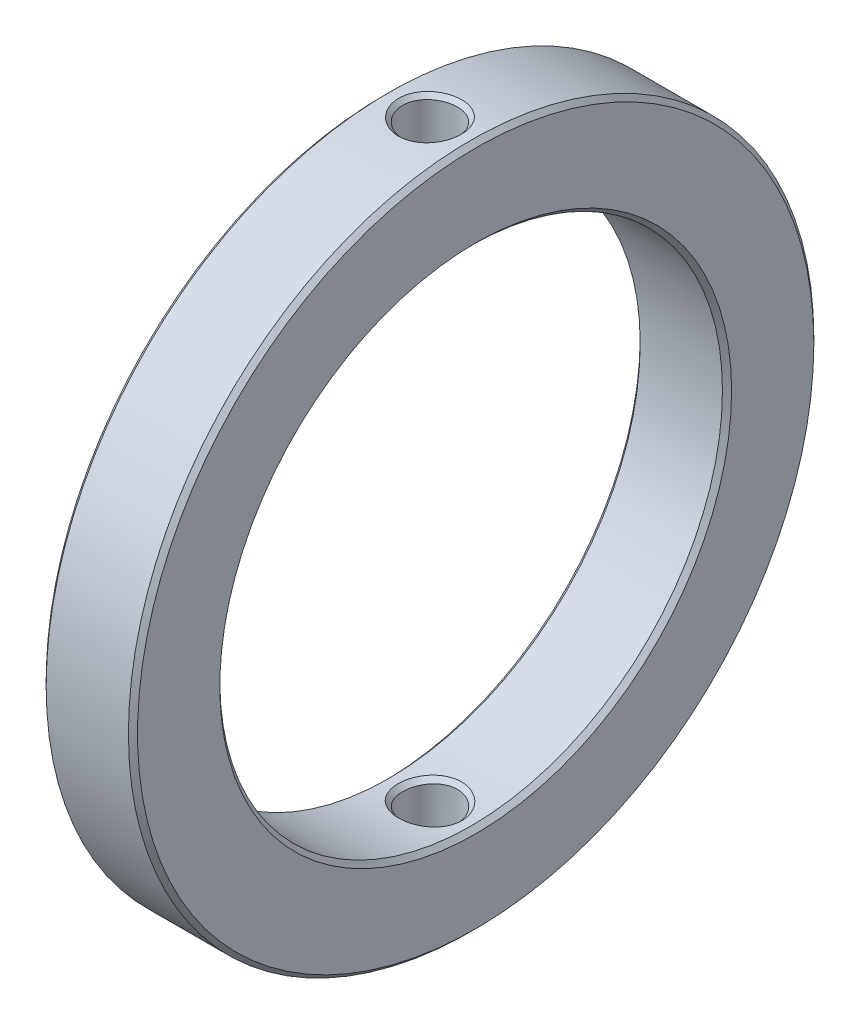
ISO-10303-21;
HEADER;
FILE_DESCRIPTION(('STEP AP214'),'2;1');
FILE_NAME('part.step','',(''),(''),'','','');
FILE_SCHEMA(('AUTOMOTIVE_DESIGN { 1 0 10303 214 1 1 1 1 }'));
ENDSEC;
DATA;
#1=APPLICATION_CONTEXT('core data for automotive mechanical design processes');
#2=APPLICATION_PROTOCOL_DEFINITION('international standard','automotive_design',2000,#1);
#3=PRODUCT_CONTEXT('',#1,'mechanical');
#4=PRODUCT('Part','Part','',(#3));
#5=PRODUCT_RELATED_PRODUCT_CATEGORY('part','',(#4));
#6=PRODUCT_DEFINITION_FORMATION('','',#4);
#7=PRODUCT_DEFINITION_CONTEXT('part definition',#1,'design');
#8=PRODUCT_DEFINITION('design','',#6,#7);
#9=PRODUCT_DEFINITION_SHAPE('','',#8);
#10=(LENGTH_UNIT() NAMED_UNIT(*) SI_UNIT(.MILLI.,.METRE.));
#11=(NAMED_UNIT(*) PLANE_ANGLE_UNIT() SI_UNIT($,.RADIAN.));
#12=(NAMED_UNIT(*) SI_UNIT($,.STERADIAN.) SOLID_ANGLE_UNIT());
#13=UNCERTAINTY_MEASURE_WITH_UNIT(LENGTH_MEASURE(1.E-05),#10,'distance_accuracy_value','');
#14=(GEOMETRIC_REPRESENTATION_CONTEXT(3) GLOBAL_UNCERTAINTY_ASSIGNED_CONTEXT((#13)) GLOBAL_UNIT_ASSIGNED_CONTEXT((#10,
#11,#12)) REPRESENTATION_CONTEXT('',''));
#15=CARTESIAN_POINT('',(0.,0.,0.));
#16=DIRECTION('',(0.,0.,1.));
#17=DIRECTION('',(1.,0.,0.));
#18=AXIS2_PLACEMENT_3D('',#15,#16,#17);
#19=CARTESIAN_POINT('',(10.,0.,0.));
#20=DIRECTION('',(1.,0.,0.));
#21=DIRECTION('',(0.,0.,-1.));
#22=AXIS2_PLACEMENT_3D('',#19,#20,#21);
#23=PLANE('',#22);
#24=CARTESIAN_POINT('',(10.,0.,0.));
#25=DIRECTION('',(1.,0.,0.));
#26=DIRECTION('',(0.,0.,-1.));
#27=AXIS2_PLACEMENT_3D('',#24,#25,#26);
#28=CIRCLE('',#27,28.);
#29=CARTESIAN_POINT('',(10.,0.,-28.));
#30=VERTEX_POINT('',#29);
#31=EDGE_CURVE('E178',#30,#30,#28,.F.);
#32=ORIENTED_EDGE('',*,*,#31,.T.);
#33=EDGE_LOOP('',(#32));
#34=FACE_BOUND('',#33,.T.);
#35=CARTESIAN_POINT('',(10.,0.,0.));
#36=DIRECTION('',(1.,0.,0.));
#37=DIRECTION('',(0.,0.,-1.));
#38=AXIS2_PLACEMENT_3D('',#35,#36,#37);
#39=CIRCLE('',#38,37.);
#40=CARTESIAN_POINT('',(10.,0.,-37.));
#41=VERTEX_POINT('',#40);
#42=EDGE_CURVE('E182',#41,#41,#39,.T.);
#43=ORIENTED_EDGE('',*,*,#42,.T.);
#44=EDGE_LOOP('',(#43));
#45=FACE_BOUND('',#44,.T.);
#46=ADVANCED_FACE('F28',(#34,#45),#23,.T.);
#47=CARTESIAN_POINT('',(0.,0.,0.));
#48=DIRECTION('',(1.,0.,0.));
#49=DIRECTION('',(0.,0.,-1.));
#50=AXIS2_PLACEMENT_3D('',#47,#48,#49);
#51=PLANE('',#50);
#52=CARTESIAN_POINT('',(0.,0.,0.));
#53=DIRECTION('',(1.,0.,0.));
#54=DIRECTION('',(0.,0.,-1.));
#55=AXIS2_PLACEMENT_3D('',#52,#53,#54);
#56=CIRCLE('',#55,28.);
#57=CARTESIAN_POINT('',(0.,0.,-28.));
#58=VERTEX_POINT('',#57);
#59=EDGE_CURVE('E296',#58,#58,#56,.T.);
#60=ORIENTED_EDGE('',*,*,#59,.T.);
#61=EDGE_LOOP('',(#60));
#62=FACE_BOUND('',#61,.T.);
#63=CARTESIAN_POINT('',(0.,0.,0.));
#64=DIRECTION('',(1.,0.,0.));
#65=DIRECTION('',(0.,0.,-1.));
#66=AXIS2_PLACEMENT_3D('',#63,#64,#65);
#67=CIRCLE('',#66,37.);
#68=CARTESIAN_POINT('',(0.,0.,-37.));
#69=VERTEX_POINT('',#68);
#70=EDGE_CURVE('E294',#69,#69,#67,.F.);
#71=ORIENTED_EDGE('',*,*,#70,.T.);
#72=EDGE_LOOP('',(#71));
#73=FACE_BOUND('',#72,.T.);
#74=ADVANCED_FACE('F253',(#62,#73),#51,.F.);
#75=CARTESIAN_POINT('',(10.,0.,0.));
#76=DIRECTION('',(-1.,0.,0.));
#77=DIRECTION('',(0.,0.,1.));
#78=AXIS2_PLACEMENT_3D('',#75,#76,#77);
#79=CYLINDRICAL_SURFACE('',#78,37.5);
#80=CARTESIAN_POINT('',(0.499999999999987,0.,0.));
#81=DIRECTION('',(1.,0.,0.));
#82=DIRECTION('',(0.,0.,-1.));
#83=AXIS2_PLACEMENT_3D('',#80,#81,#82);
#84=CIRCLE('',#83,37.5);
#85=CARTESIAN_POINT('',(0.499999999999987,0.,-37.5));
#86=VERTEX_POINT('',#85);
#87=EDGE_CURVE('E10',#86,#86,#84,.T.);
#88=ORIENTED_EDGE('',*,*,#87,.T.);
#89=EDGE_LOOP('',(#88));
#90=FACE_BOUND('',#89,.T.);
#91=CARTESIAN_POINT('',(9.50000000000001,0.,0.));
#92=DIRECTION('',(1.,0.,0.));
#93=DIRECTION('',(0.,0.,-1.));
#94=AXIS2_PLACEMENT_3D('',#91,#92,#93);
#95=CIRCLE('',#94,37.5);
#96=CARTESIAN_POINT('',(9.50000000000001,0.,-37.5));
#97=VERTEX_POINT('',#96);
#98=EDGE_CURVE('E40',#97,#97,#95,.F.);
#99=ORIENTED_EDGE('',*,*,#98,.T.);
#100=EDGE_LOOP('',(#99));
#101=FACE_BOUND('',#100,.T.);
#102=CARTESIAN_POINT('',(5.,37.3400179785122,3.46021059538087));
#103=CARTESIAN_POINT('',(5.05596128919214,37.340015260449,3.46024559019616));
#104=CARTESIAN_POINT('',(5.11192116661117,37.3401585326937,3.45882581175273));
#105=CARTESIAN_POINT('',(5.22364777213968,37.3407215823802,3.45312540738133));
#106=CARTESIAN_POINT('',(5.27941462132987,37.3411411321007,3.44884713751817));
#107=CARTESIAN_POINT('',(5.39063464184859,37.3422410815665,3.4374806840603));
#108=CARTESIAN_POINT('',(5.44608793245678,37.3429213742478,3.43039365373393));
#109=CARTESIAN_POINT('',(5.55656208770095,37.3445270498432,3.41346164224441));
#110=CARTESIAN_POINT('',(5.61158299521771,37.3454524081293,3.40361693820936));
#111=CARTESIAN_POINT('',(5.72107324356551,37.3475325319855,3.38122084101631));
#112=CARTESIAN_POINT('',(5.77554251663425,37.3486873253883,3.36866911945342));
#113=CARTESIAN_POINT('',(5.88381049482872,37.3512106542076,3.34091008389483));
#114=CARTESIAN_POINT('',(5.93760901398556,37.3525792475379,3.32570205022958));
#115=CARTESIAN_POINT('',(6.04441644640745,37.3555145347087,3.29268125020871));
#116=CARTESIAN_POINT('',(6.09742506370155,37.3570813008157,3.27486753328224));
#117=CARTESIAN_POINT('',(6.20253364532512,37.3603973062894,3.23668607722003));
#118=CARTESIAN_POINT('',(6.25463321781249,37.3621466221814,3.21631726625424));
#119=CARTESIAN_POINT('',(6.35780463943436,37.3658121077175,3.17307622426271));
#120=CARTESIAN_POINT('',(6.40887601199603,37.367728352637,3.15020286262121));
#121=CARTESIAN_POINT('',(6.50987194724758,37.3717120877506,3.1020032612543));
#122=CARTESIAN_POINT('',(6.55979594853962,37.3737796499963,3.07667585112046));
#123=CARTESIAN_POINT('',(6.65837805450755,37.3780503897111,3.02361867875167));
#124=CARTESIAN_POINT('',(6.70703549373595,37.380253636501,2.99588768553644));
#125=CARTESIAN_POINT('',(6.80296539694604,37.3847802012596,2.93807388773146));
#126=CARTESIAN_POINT('',(6.85023704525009,37.3871035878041,2.9079897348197));
#127=CARTESIAN_POINT('',(6.94327637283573,37.3918545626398,2.84552023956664));
#128=CARTESIAN_POINT('',(6.98904300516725,37.394282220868,2.8131333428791));
#129=CARTESIAN_POINT('',(7.0789532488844,37.3992270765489,2.74610897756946));
#130=CARTESIAN_POINT('',(7.12309545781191,37.4017443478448,2.71146963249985));
#131=CARTESIAN_POINT('',(7.2096384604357,37.4068492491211,2.63999144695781));
#132=CARTESIAN_POINT('',(7.25203732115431,37.4094369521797,2.60315027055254));
#133=CARTESIAN_POINT('',(7.33497343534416,37.4146804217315,2.52731834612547));
#134=CARTESIAN_POINT('',(7.37550798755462,37.4173362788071,2.48832464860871));
#135=CARTESIAN_POINT('',(7.45455992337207,37.4226477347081,2.40828612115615));
#136=CARTESIAN_POINT('',(7.49307577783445,37.4253033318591,2.36723978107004));
#137=CARTESIAN_POINT('',(7.56799901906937,37.4305460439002,2.28325950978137));
#138=CARTESIAN_POINT('',(7.60440630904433,37.4331331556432,2.24032549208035));
#139=CARTESIAN_POINT('',(7.67506011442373,37.4382367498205,2.15268997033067));
#140=CARTESIAN_POINT('',(7.70930596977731,37.4407532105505,2.10798793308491));
#141=CARTESIAN_POINT('',(7.77558640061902,37.4456964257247,2.01693742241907));
#142=CARTESIAN_POINT('',(7.80761993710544,37.4481231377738,1.97058819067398));
#143=CARTESIAN_POINT('',(7.86942449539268,37.4528723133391,1.87636380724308));
#144=CARTESIAN_POINT('',(7.89919426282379,37.4551947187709,1.82848783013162));
#145=CARTESIAN_POINT('',(7.95642002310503,37.4597195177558,1.73133041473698));
#146=CARTESIAN_POINT('',(7.98387468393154,37.4619218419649,1.68204818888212));
#147=CARTESIAN_POINT('',(8.03641879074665,37.4661910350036,1.58219861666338));
#148=CARTESIAN_POINT('',(8.06150693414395,37.4682578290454,1.53163058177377));
#149=CARTESIAN_POINT('',(8.1092664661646,37.4722404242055,1.42932968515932));
#150=CARTESIAN_POINT('',(8.13193665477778,37.4741561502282,1.37759626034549));
#151=CARTESIAN_POINT('',(8.17480865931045,37.4778210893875,1.27308485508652));
#152=CARTESIAN_POINT('',(8.19500941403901,37.4795702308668,1.2203064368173));
#153=CARTESIAN_POINT('',(8.23289089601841,37.4828864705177,1.11382531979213));
#154=CARTESIAN_POINT('',(8.25057069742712,37.4844535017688,1.0601222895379));
#155=CARTESIAN_POINT('',(8.28335862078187,37.4873899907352,0.951912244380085));
#156=CARTESIAN_POINT('',(8.2984659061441,37.4887593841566,0.89740497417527));
#157=CARTESIAN_POINT('',(8.32605719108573,37.4912850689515,0.787706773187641));
#158=CARTESIAN_POINT('',(8.33854035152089,37.4924412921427,0.732515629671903));
#159=CARTESIAN_POINT('',(8.36083187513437,37.4945251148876,0.621570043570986));
#160=CARTESIAN_POINT('',(8.37063925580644,37.4954526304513,0.565815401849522));
#161=CARTESIAN_POINT('',(8.38752784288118,37.4970635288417,0.45386318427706));
#162=CARTESIAN_POINT('',(8.39460773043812,37.4977467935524,0.397665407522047));
#163=CARTESIAN_POINT('',(8.40599017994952,37.4988537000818,0.284947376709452));
#164=CARTESIAN_POINT('',(8.41029083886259,37.4992771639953,0.228426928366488));
#165=CARTESIAN_POINT('',(8.41606381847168,37.499849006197,0.115183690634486));
#166=CARTESIAN_POINT('',(8.41753334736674,37.4999971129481,0.058460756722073));
#167=CARTESIAN_POINT('',(8.41759374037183,37.5000028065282,-0.0549854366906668));
#168=CARTESIAN_POINT('',(8.41618466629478,37.4998603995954,-0.111708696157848));
#169=CARTESIAN_POINT('',(8.41053280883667,37.4992998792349,-0.224953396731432));
#170=CARTESIAN_POINT('',(8.40629293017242,37.498882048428,-0.281474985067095));
#171=CARTESIAN_POINT('',(8.3950319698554,37.4977862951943,-0.394196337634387));
#172=CARTESIAN_POINT('',(8.38801288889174,37.4971085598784,-0.450396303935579));
#173=CARTESIAN_POINT('',(8.37124575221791,37.4955085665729,-0.562354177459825));
#174=CARTESIAN_POINT('',(8.36149909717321,37.4945864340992,-0.61811229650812));
#175=CARTESIAN_POINT('',(8.33932871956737,37.4925131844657,-0.729066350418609));
#176=CARTESIAN_POINT('',(8.32690604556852,37.4913621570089,-0.784262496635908));
#177=CARTESIAN_POINT('',(8.29943529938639,37.4888466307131,-0.893972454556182));
#178=CARTESIAN_POINT('',(8.28438811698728,37.4874822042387,-0.948486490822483));
#179=CARTESIAN_POINT('',(8.2517198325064,37.4845553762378,-1.0567120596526));
#180=CARTESIAN_POINT('',(8.23409960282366,37.4829930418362,-1.11042385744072));
#181=CARTESIAN_POINT('',(8.19633656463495,37.4796858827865,-1.21692474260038));
#182=CARTESIAN_POINT('',(8.17619470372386,37.4779411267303,-1.2697141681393));
#183=CARTESIAN_POINT('',(8.13343965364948,37.4742846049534,-1.37425006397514));
#184=CARTESIAN_POINT('',(8.11082753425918,37.4723729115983,-1.42599697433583));
#185=CARTESIAN_POINT('',(8.06318317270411,37.4683979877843,-1.52832756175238));
#186=CARTESIAN_POINT('',(8.0381521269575,37.4663348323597,-1.57891179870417));
#187=CARTESIAN_POINT('',(7.98572111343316,37.4620724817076,-1.67879674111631));
#188=CARTESIAN_POINT('',(7.95832243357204,37.4598733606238,-1.72809812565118));
#189=CARTESIAN_POINT('',(7.90120739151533,37.4553544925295,-1.82529706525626));
#190=CARTESIAN_POINT('',(7.87149233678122,37.4530348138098,-1.87319539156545));
#191=CARTESIAN_POINT('',(7.80979584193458,37.4482905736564,-1.96746794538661));
#192=CARTESIAN_POINT('',(7.77781562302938,37.4458660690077,-2.01384297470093));
#193=CARTESIAN_POINT('',(7.71164025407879,37.4409267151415,-2.10494872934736));
#194=CARTESIAN_POINT('',(7.67744610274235,37.4384119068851,-2.14968018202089));
#195=CARTESIAN_POINT('',(7.60689426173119,37.4333110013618,-2.23737869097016));
#196=CARTESIAN_POINT('',(7.57053718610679,37.4307249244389,-2.28034624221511));
#197=CARTESIAN_POINT('',(7.4957117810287,37.4254837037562,-2.36439701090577));
#198=CARTESIAN_POINT('',(7.4572434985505,37.4228285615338,-2.40548027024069));
#199=CARTESIAN_POINT('',(7.37828954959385,37.4175172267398,-2.48559799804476));
#200=CARTESIAN_POINT('',(7.33780545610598,37.4148610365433,-2.52463401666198));
#201=CARTESIAN_POINT('',(7.25497637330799,37.4096160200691,-2.60055677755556));
#202=CARTESIAN_POINT('',(7.21263421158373,37.4070271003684,-2.63744659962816));
#203=CARTESIAN_POINT('',(7.12620771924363,37.4019190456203,-2.70902650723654));
#204=CARTESIAN_POINT('',(7.08212543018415,37.3993998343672,-2.74371905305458));
#205=CARTESIAN_POINT('',(6.99233638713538,37.3944504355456,-2.81085377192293));
#206=CARTESIAN_POINT('',(6.94663111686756,37.3920201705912,-2.84329792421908));
#207=CARTESIAN_POINT('',(6.85371379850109,37.3872634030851,-2.90588507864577));
#208=CARTESIAN_POINT('',(6.80650284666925,37.3849368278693,-2.93602970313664));
#209=CARTESIAN_POINT('',(6.7106916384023,37.3804033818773,-2.99396689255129));
#210=CARTESIAN_POINT('',(6.6620922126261,37.3781964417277,-3.02176082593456));
#211=CARTESIAN_POINT('',(6.56362143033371,37.3739178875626,-3.074945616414));
#212=CARTESIAN_POINT('',(6.51375071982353,37.3718462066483,-3.1003376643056));
#213=CARTESIAN_POINT('',(6.41285466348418,37.3678538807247,-3.14866758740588));
#214=CARTESIAN_POINT('',(6.36182982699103,37.3659331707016,-3.17160652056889));
#215=CARTESIAN_POINT('',(6.25874277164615,37.3622584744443,-3.21497907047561));
#216=CARTESIAN_POINT('',(6.20668094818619,37.3605044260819,-3.23541362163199));
#217=CARTESIAN_POINT('',(6.10163715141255,37.3571787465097,-3.27372625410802));
#218=CARTESIAN_POINT('',(6.04865546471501,37.355607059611,-3.2916051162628));
#219=CARTESIAN_POINT('',(5.94188917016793,37.3526617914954,-3.32475524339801));
#220=CARTESIAN_POINT('',(5.88810473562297,37.3512881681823,-3.34002706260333));
#221=CARTESIAN_POINT('',(5.77985017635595,37.3487547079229,-3.36791206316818));
#222=CARTESIAN_POINT('',(5.72538010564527,37.347594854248,-3.38052545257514));
#223=CARTESIAN_POINT('',(5.61587151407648,37.3455046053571,-3.40304262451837));
#224=CARTESIAN_POINT('',(5.56083292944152,37.3445742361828,-3.41294609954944));
#225=CARTESIAN_POINT('',(5.45030452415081,37.3429585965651,-3.42999282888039));
#226=CARTESIAN_POINT('',(5.39481454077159,37.3422734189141,-3.43713503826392));
#227=CARTESIAN_POINT('',(5.28350060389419,37.341163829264,-3.44860816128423));
#228=CARTESIAN_POINT('',(5.22767643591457,37.3407396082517,-3.45293701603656));
#229=CARTESIAN_POINT('',(5.11581105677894,37.340167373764,-3.45873519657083));
#230=CARTESIAN_POINT('',(5.05976966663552,37.340019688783,-3.46020112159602));
#231=CARTESIAN_POINT('',(4.94766031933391,37.3400166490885,-3.46021595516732));
#232=CARTESIAN_POINT('',(4.89159236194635,37.3401614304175,-3.45876350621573));
#233=CARTESIAN_POINT('',(4.77962561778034,37.3407286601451,-3.45298154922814));
#234=CARTESIAN_POINT('',(4.72372678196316,37.3411510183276,-3.44865297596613));
#235=CARTESIAN_POINT('',(4.61222185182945,37.3422573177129,-3.43717535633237));
#236=CARTESIAN_POINT('',(4.55661576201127,37.3429412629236,-3.43002626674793));
#237=CARTESIAN_POINT('',(4.44582018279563,37.3445548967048,-3.41296118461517));
#238=CARTESIAN_POINT('',(4.39063079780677,37.3454846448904,-3.40304452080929));
#239=CARTESIAN_POINT('',(4.28079236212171,37.3475740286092,-3.38049821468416));
#240=CARTESIAN_POINT('',(4.22614352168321,37.3487337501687,-3.36786755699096));
#241=CARTESIAN_POINT('',(4.11750994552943,37.3512672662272,-3.33994672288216));
#242=CARTESIAN_POINT('',(4.06352550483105,37.3526411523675,-3.32465540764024));
#243=CARTESIAN_POINT('',(3.95634452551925,37.3555871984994,-3.29146655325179));
#244=CARTESIAN_POINT('',(3.90314833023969,37.3571594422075,-3.27356791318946));
#245=CARTESIAN_POINT('',(3.79766768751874,37.3604864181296,-3.23521753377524));
#246=CARTESIAN_POINT('',(3.74538359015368,37.3622412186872,-3.21476483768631));
#247=CARTESIAN_POINT('',(3.64185103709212,37.3659175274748,-3.17135937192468));
#248=CARTESIAN_POINT('',(3.59060290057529,37.3678390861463,-3.1484058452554));
#249=CARTESIAN_POINT('',(3.48926620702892,37.3718331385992,-3.10005168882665));
#250=CARTESIAN_POINT('',(3.43917791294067,37.3739056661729,-3.07465051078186));
#251=CARTESIAN_POINT('',(3.34028486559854,37.3781858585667,-3.02145401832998));
#252=CARTESIAN_POINT('',(3.29148031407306,37.3803935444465,-2.99365833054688));
#253=CARTESIAN_POINT('',(3.19527873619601,37.3849283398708,-2.93572580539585));
#254=CARTESIAN_POINT('',(3.1478818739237,37.3872554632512,-2.90558869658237));
#255=CARTESIAN_POINT('',(3.05461957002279,37.3920130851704,-2.84302644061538));
#256=CARTESIAN_POINT('',(3.00875431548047,37.3944435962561,-2.81060101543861));
#257=CARTESIAN_POINT('',(2.91867929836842,37.3993931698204,-2.74351515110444));
#258=CARTESIAN_POINT('',(2.87446985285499,37.4019122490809,-2.70885428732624));
#259=CARTESIAN_POINT('',(2.78782951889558,37.4070195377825,-2.63735143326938));
#260=CARTESIAN_POINT('',(2.7453992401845,37.4096077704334,-2.60050870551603));
#261=CARTESIAN_POINT('',(2.66244347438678,37.4148510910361,-2.52469346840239));
#262=CARTESIAN_POINT('',(2.62191912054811,37.4175062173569,-2.48571972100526));
#263=CARTESIAN_POINT('',(2.54291383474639,37.4228153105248,-2.40572950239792));
#264=CARTESIAN_POINT('',(2.50443354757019,37.4254692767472,-2.36471239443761));
#265=CARTESIAN_POINT('',(2.42958457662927,37.4307082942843,-2.28078835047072));
#266=CARTESIAN_POINT('',(2.39321599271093,37.4332933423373,-2.23788132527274));
#267=CARTESIAN_POINT('',(2.32264349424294,37.4383925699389,-2.15029717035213));
#268=CARTESIAN_POINT('',(2.28844025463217,37.4409067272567,-2.1056194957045));
#269=CARTESIAN_POINT('',(2.22224831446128,37.445845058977,-2.01461607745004));
#270=CARTESIAN_POINT('',(2.19026067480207,37.4482691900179,-1.96828956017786));
#271=CARTESIAN_POINT('',(2.12855091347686,37.4530129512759,-1.87410958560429));
#272=CARTESIAN_POINT('',(2.09883007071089,37.455332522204,-1.82625528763));
#273=CARTESIAN_POINT('',(2.04170481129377,37.4598514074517,-1.7291409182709));
#274=CARTESIAN_POINT('',(2.01430174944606,37.4620506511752,-1.67988004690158));
#275=CARTESIAN_POINT('',(1.96186317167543,37.4663134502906,-1.58007355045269));
#276=CARTESIAN_POINT('',(1.93682897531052,37.4683769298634,-1.52952722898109));
#277=CARTESIAN_POINT('',(1.88917934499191,37.4723526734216,-1.42727081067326));
#278=CARTESIAN_POINT('',(1.8665651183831,37.4742648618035,-1.37556014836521));
#279=CARTESIAN_POINT('',(1.82380672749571,37.4779225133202,-1.27109600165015));
#280=CARTESIAN_POINT('',(1.80366361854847,37.4796679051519,-1.21834208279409));
#281=CARTESIAN_POINT('',(1.76589880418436,37.482976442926,-1.11191238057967));
#282=CARTESIAN_POINT('',(1.74827800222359,37.4845395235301,-1.05823627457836));
#283=CARTESIAN_POINT('',(1.71560913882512,37.4874679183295,-0.950083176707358));
#284=CARTESIAN_POINT('',(1.70056187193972,37.4888331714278,-0.895605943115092));
#285=CARTESIAN_POINT('',(1.67309139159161,37.4913503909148,-0.785971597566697));
#286=CARTESIAN_POINT('',(1.66066895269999,37.4925022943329,-0.730814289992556));
#287=CARTESIAN_POINT('',(1.63849928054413,37.4945773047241,-0.619940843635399));
#288=CARTESIAN_POINT('',(1.62875293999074,37.4955003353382,-0.564224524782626));
#289=CARTESIAN_POINT('',(1.61198674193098,37.4971020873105,-0.452354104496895));
#290=CARTESIAN_POINT('',(1.60496808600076,37.4977807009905,-0.396199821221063));
#291=CARTESIAN_POINT('',(1.59370735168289,37.4988781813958,-0.283574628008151));
#292=CARTESIAN_POINT('',(1.58946702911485,37.4992968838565,-0.227103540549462));
#293=CARTESIAN_POINT('',(1.58381650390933,37.4998589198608,-0.113965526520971));
#294=CARTESIAN_POINT('',(1.58240891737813,37.5000019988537,-0.0572984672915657));
#295=CARTESIAN_POINT('',(1.58246324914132,37.4999979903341,0.0560383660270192));
#296=CARTESIAN_POINT('',(1.58392538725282,37.4998508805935,0.11270813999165));
#297=CARTESIAN_POINT('',(1.58966505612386,37.4992819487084,0.225857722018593));
#298=CARTESIAN_POINT('',(1.59394035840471,37.4988603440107,0.282337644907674));
#299=CARTESIAN_POINT('',(1.60525923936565,37.4977577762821,0.394986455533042));
#300=CARTESIAN_POINT('',(1.61230136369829,37.4970769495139,0.451155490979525));
#301=CARTESIAN_POINT('',(1.62910343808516,37.4954714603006,0.56306126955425));
#302=CARTESIAN_POINT('',(1.63886242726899,37.4945468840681,0.618798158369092));
#303=CARTESIAN_POINT('',(1.66104904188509,37.4924693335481,0.729718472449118));
#304=CARTESIAN_POINT('',(1.67347597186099,37.4913164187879,0.784902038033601));
#305=CARTESIAN_POINT('',(1.70094923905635,37.4887976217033,0.894594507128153));
#306=CARTESIAN_POINT('',(1.71599497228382,37.4874317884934,0.949103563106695));
#307=CARTESIAN_POINT('',(1.74865685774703,37.4845025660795,1.05732579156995));
#308=CARTESIAN_POINT('',(1.76627237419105,37.4829392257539,1.11103915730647));
#309=CARTESIAN_POINT('',(1.80402493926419,37.4796303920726,1.21754874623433));
#310=CARTESIAN_POINT('',(1.82416124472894,37.4778849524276,1.2703452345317));
#311=CARTESIAN_POINT('',(1.86690657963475,37.474227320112,1.374899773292));
#312=CARTESIAN_POINT('',(1.88951472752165,37.4723151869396,1.42665818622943));
#313=CARTESIAN_POINT('',(1.93715496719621,37.4683395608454,1.52901524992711));
#314=CARTESIAN_POINT('',(1.96218604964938,37.4662761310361,1.57961437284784));
#315=CARTESIAN_POINT('',(2.01462336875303,37.4620133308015,1.67953151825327));
#316=CARTESIAN_POINT('',(2.04202851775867,37.459814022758,1.72885011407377));
#317=CARTESIAN_POINT('',(2.09916512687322,37.4552948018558,1.82608487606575));
#318=CARTESIAN_POINT('',(2.12889550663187,37.4529749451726,1.87400167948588));
#319=CARTESIAN_POINT('',(2.19063366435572,37.4482302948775,1.96831156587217));
#320=CARTESIAN_POINT('',(2.22264048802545,37.4458055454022,2.0147052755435));
#321=CARTESIAN_POINT('',(2.28888244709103,37.4408655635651,2.10584776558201));
#322=CARTESIAN_POINT('',(2.32311690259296,37.4383503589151,2.15059704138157));
#323=CARTESIAN_POINT('',(2.39376510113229,37.4332484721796,2.23832956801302));
#324=CARTESIAN_POINT('',(2.43017861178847,37.4306617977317,2.28131300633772));
#325=CARTESIAN_POINT('',(2.50513494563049,37.425419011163,2.36539299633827));
#326=CARTESIAN_POINT('',(2.54367817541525,37.4227628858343,2.40648918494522));
#327=CARTESIAN_POINT('',(2.62279759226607,37.4174498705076,2.48662414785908));
#328=CARTESIAN_POINT('',(2.66337247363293,37.4147929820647,2.52566421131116));
#329=CARTESIAN_POINT('',(2.74639187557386,37.4095474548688,2.60158309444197));
#330=CARTESIAN_POINT('',(2.78883361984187,37.4069587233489,2.63846494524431));
#331=CARTESIAN_POINT('',(2.87546511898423,37.4018517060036,2.71001885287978));
#332=CARTESIAN_POINT('',(2.91965289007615,37.3993333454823,2.74469330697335));
#333=CARTESIAN_POINT('',(3.00965590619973,37.3943862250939,2.81178361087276));
#334=CARTESIAN_POINT('',(3.05546971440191,37.3919573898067,2.84420138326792));
#335=CARTESIAN_POINT('',(3.14860428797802,37.3872039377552,2.90672936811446));
#336=CARTESIAN_POINT('',(3.19592398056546,37.3848792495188,2.93684117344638));
#337=CARTESIAN_POINT('',(3.2919500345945,37.3803499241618,2.9947081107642));
#338=CARTESIAN_POINT('',(3.34065555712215,37.37814521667,3.02246462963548));
#339=CARTESIAN_POINT('',(3.43933308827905,37.3738713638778,3.0755717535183));
#340=CARTESIAN_POINT('',(3.48930440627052,37.3718021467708,3.10092363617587));
#341=CARTESIAN_POINT('',(3.59039342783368,37.367814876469,3.14917214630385));
#342=CARTESIAN_POINT('',(3.64151053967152,37.3658967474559,3.17207000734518));
#343=CARTESIAN_POINT('',(3.74477109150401,37.3622272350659,3.21536106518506));
#344=CARTESIAN_POINT('',(3.79691401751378,37.3604757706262,3.23575548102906));
#345=CARTESIAN_POINT('',(3.90210615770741,37.357155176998,3.27399020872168));
#346=CARTESIAN_POINT('',(3.95515493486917,37.3555859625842,3.29183171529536));
#347=CARTESIAN_POINT('',(4.06203873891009,37.3526454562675,3.32491119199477));
#348=CARTESIAN_POINT('',(4.11587341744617,37.3512740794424,3.34015027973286));
#349=CARTESIAN_POINT('',(4.22420896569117,37.3487448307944,3.36797554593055));
#350=CARTESIAN_POINT('',(4.27870959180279,37.3475868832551,3.38056266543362));
#351=CARTESIAN_POINT('',(4.38825699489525,37.3455000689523,3.40303469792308));
#352=CARTESIAN_POINT('',(4.44330364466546,37.3445711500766,3.41292022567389));
#353=CARTESIAN_POINT('',(4.55382292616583,37.3429579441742,3.42994002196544));
#354=CARTESIAN_POINT('',(4.60929554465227,37.3422736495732,3.43707437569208));
#355=CARTESIAN_POINT('',(4.7205470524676,37.3411652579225,3.44854263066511));
#356=CARTESIAN_POINT('',(4.77632601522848,37.3407412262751,3.45287582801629));
#357=CARTESIAN_POINT('',(4.88806885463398,37.3401687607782,3.45869413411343));
#358=CARTESIAN_POINT('',(4.94403282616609,37.3400205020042,3.46017743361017));
#359=CARTESIAN_POINT('',(5.,37.3400179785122,3.46021059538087));
#360=B_SPLINE_CURVE_WITH_KNOTS('',3,(#102,#103,#104,#105,#106,#107,#108,#109,#110,#111,#112,
#113,#114,#115,#116,#117,#118,#119,#120,#121,#122,#123,#124,#125,#126,#127,#128,#129,#130,#131,
#132,#133,#134,#135,#136,#137,#138,#139,#140,#141,#142,#143,#144,#145,#146,#147,#148,#149,#150,
#151,#152,#153,#154,#155,#156,#157,#158,#159,#160,#161,#162,#163,#164,#165,#166,#167,#168,#169,
#170,#171,#172,#173,#174,#175,#176,#177,#178,#179,#180,#181,#182,#183,#184,#185,#186,#187,#188,
#189,#190,#191,#192,#193,#194,#195,#196,#197,#198,#199,#200,#201,#202,#203,#204,#205,#206,#207,
#208,#209,#210,#211,#212,#213,#214,#215,#216,#217,#218,#219,#220,#221,#222,#223,#224,#225,#226,
#227,#228,#229,#230,#231,#232,#233,#234,#235,#236,#237,#238,#239,#240,#241,#242,#243,#244,#245,
#246,#247,#248,#249,#250,#251,#252,#253,#254,#255,#256,#257,#258,#259,#260,#261,#262,#263,#264,
#265,#266,#267,#268,#269,#270,#271,#272,#273,#274,#275,#276,#277,#278,#279,#280,#281,#282,#283,
#284,#285,#286,#287,#288,#289,#290,#291,#292,#293,#294,#295,#296,#297,#298,#299,#300,#301,#302,
#303,#304,#305,#306,#307,#308,#309,#310,#311,#312,#313,#314,#315,#316,#317,#318,#319,#320,#321,
#322,#323,#324,#325,#326,#327,#328,#329,#330,#331,#332,#333,#334,#335,#336,#337,#338,#339,#340,
#341,#342,#343,#344,#345,#346,#347,#348,#349,#350,#351,#352,#353,#354,#355,#356,#357,#358,#359),
.UNSPECIFIED.,.F.,.F.,(4,2,2,2,2,2,2,2,2,2,2,2,2,2,2,2,2,2,2,2,2,2,2,2,2,2,2,2,2,2,2,2,2,2,2,2,
2,2,2,2,2,2,2,2,2,2,2,2,2,2,2,2,2,2,2,2,2,2,2,2,2,2,2,2,2,2,2,2,2,2,2,2,2,2,2,2,2,2,2,2,2,2,2,2,
2,2,2,2,2,2,2,2,2,2,2,2,2,2,2,2,2,2,2,2,2,2,2,2,2,2,2,2,2,2,2,2,2,2,2,2,2,2,2,2,2,2,2,2,4),(0.,
0.167861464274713,0.33558474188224,0.503239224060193,0.67087686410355,0.838534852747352,
1.0062383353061,1.17400315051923,1.34183857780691,1.50975008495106,1.67774207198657,
1.84582060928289,2.01399616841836,2.18228634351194,2.3507185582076,2.51933274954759,
2.6881840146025,2.85716138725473,3.02614651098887,3.19518299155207,3.36429832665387,
3.53350669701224,3.70281176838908,3.87220949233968,4.04169089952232,4.21124488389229,
4.38086097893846,4.55053212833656,4.72025745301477,4.89004501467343,5.05991457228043,
5.22990032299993,5.40005361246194,5.57020324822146,5.74017855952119,5.91003173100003,
6.07979783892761,6.24949754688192,6.41913983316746,6.588724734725,6.75824609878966,
6.92769433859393,7.09705919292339,7.26633249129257,7.43551092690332,7.60459883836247,
7.77361099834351,7.94257540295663,8.11153604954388,8.28036685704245,8.44894909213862,
8.61733910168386,8.78557894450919,8.95369897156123,9.12172044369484,9.28965817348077,
9.45752318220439,9.62532536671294,9.79307617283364,9.96079127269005,10.1284932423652,
10.2962142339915,10.4639986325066,10.6319056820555,10.8000120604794,10.9681966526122,
11.1363266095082,11.3044591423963,11.4726324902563,11.6408688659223,11.809177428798,
11.9775572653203,12.1460003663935,12.3144945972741,12.48302665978,12.65158504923,
12.8201630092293,12.9887614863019,13.1573920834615,13.3260800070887,13.4948669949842,
13.6637069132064,13.8325548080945,14.0014550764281,14.1704356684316,14.3395109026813,
14.5086842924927,14.6779513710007,14.8473025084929,15.0167257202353,15.186209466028,
15.3557454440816,15.525331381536,15.6949738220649,15.8646909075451,16.0345151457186,
16.2044961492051,16.3744901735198,16.5443496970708,16.714120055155,16.8838304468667,
17.0534966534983,17.2231237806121,17.3927090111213,17.5622443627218,17.7317194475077,
17.9011242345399,18.0704518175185,18.2397011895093,18.4088800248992,18.5780074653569,
18.7471169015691,18.9162587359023,19.08529322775,19.2540843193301,19.4226888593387,
19.5911479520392,19.7594896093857,19.9277314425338,20.0958833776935,20.2639503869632,
20.4319352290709,20.5998411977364,20.767674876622,20.9354488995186,21.1031847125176,
21.2709153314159,21.4386880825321,21.6065673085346),.UNSPECIFIED.);
#361=CARTESIAN_POINT('',(5.,37.3400179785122,3.46021059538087));
#362=VERTEX_POINT('',#361);
#363=EDGE_CURVE('E45',#362,#362,#360,.F.);
#364=ORIENTED_EDGE('',*,*,#363,.T.);
#365=EDGE_LOOP('',(#364));
#366=FACE_BOUND('',#365,.T.);
#367=CARTESIAN_POINT('',(5.,-37.3400179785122,3.46021059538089));
#368=CARTESIAN_POINT('',(4.94403871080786,-37.340015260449,3.46024559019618));
#369=CARTESIAN_POINT('',(4.88807883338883,-37.3401585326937,3.45882581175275));
#370=CARTESIAN_POINT('',(4.77635222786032,-37.3407215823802,3.45312540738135));
#371=CARTESIAN_POINT('',(4.72058537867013,-37.3411411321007,3.44884713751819));
#372=CARTESIAN_POINT('',(4.60936535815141,-37.3422410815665,3.43748068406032));
#373=CARTESIAN_POINT('',(4.55391206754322,-37.3429213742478,3.43039365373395));
#374=CARTESIAN_POINT('',(4.44343791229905,-37.3445270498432,3.41346164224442));
#375=CARTESIAN_POINT('',(4.38841700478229,-37.3454524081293,3.40361693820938));
#376=CARTESIAN_POINT('',(4.27892675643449,-37.3475325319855,3.38122084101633));
#377=CARTESIAN_POINT('',(4.22445748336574,-37.3486873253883,3.36866911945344));
#378=CARTESIAN_POINT('',(4.11618950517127,-37.3512106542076,3.34091008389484));
#379=CARTESIAN_POINT('',(4.06239098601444,-37.3525792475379,3.3257020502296));
#380=CARTESIAN_POINT('',(3.95558355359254,-37.3555145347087,3.29268125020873));
#381=CARTESIAN_POINT('',(3.90257493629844,-37.3570813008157,3.27486753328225));
#382=CARTESIAN_POINT('',(3.79746635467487,-37.3603973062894,3.23668607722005));
#383=CARTESIAN_POINT('',(3.7453667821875,-37.3621466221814,3.21631726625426));
#384=CARTESIAN_POINT('',(3.64219536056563,-37.3658121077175,3.17307622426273));
#385=CARTESIAN_POINT('',(3.59112398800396,-37.367728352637,3.15020286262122));
#386=CARTESIAN_POINT('',(3.49012805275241,-37.3717120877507,3.10200326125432));
#387=CARTESIAN_POINT('',(3.44020405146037,-37.3737796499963,3.07667585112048));
#388=CARTESIAN_POINT('',(3.34162194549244,-37.3780503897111,3.02361867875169));
#389=CARTESIAN_POINT('',(3.29296450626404,-37.3802536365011,2.99588768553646));
#390=CARTESIAN_POINT('',(3.19703460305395,-37.3847802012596,2.93807388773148));
#391=CARTESIAN_POINT('',(3.14976295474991,-37.3871035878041,2.90798973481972));
#392=CARTESIAN_POINT('',(3.05672362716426,-37.3918545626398,2.84552023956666));
#393=CARTESIAN_POINT('',(3.01095699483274,-37.394282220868,2.81313334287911));
#394=CARTESIAN_POINT('',(2.92104675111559,-37.3992270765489,2.74610897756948));
#395=CARTESIAN_POINT('',(2.87690454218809,-37.4017443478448,2.71146963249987));
#396=CARTESIAN_POINT('',(2.79036153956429,-37.4068492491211,2.63999144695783));
#397=CARTESIAN_POINT('',(2.74796267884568,-37.4094369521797,2.60315027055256));
#398=CARTESIAN_POINT('',(2.66502656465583,-37.4146804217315,2.52731834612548));
#399=CARTESIAN_POINT('',(2.62449201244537,-37.4173362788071,2.48832464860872));
#400=CARTESIAN_POINT('',(2.54544007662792,-37.4226477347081,2.40828612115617));
#401=CARTESIAN_POINT('',(2.50692422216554,-37.4253033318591,2.36723978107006));
#402=CARTESIAN_POINT('',(2.43200098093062,-37.4305460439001,2.28325950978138));
#403=CARTESIAN_POINT('',(2.39559369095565,-37.4331331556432,2.24032549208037));
#404=CARTESIAN_POINT('',(2.32493988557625,-37.4382367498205,2.15268997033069));
#405=CARTESIAN_POINT('',(2.29069403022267,-37.4407532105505,2.10798793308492));
#406=CARTESIAN_POINT('',(2.22441359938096,-37.4456964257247,2.01693742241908));
#407=CARTESIAN_POINT('',(2.19238006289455,-37.4481231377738,1.97058819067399));
#408=CARTESIAN_POINT('',(2.13057550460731,-37.4528723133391,1.87636380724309));
#409=CARTESIAN_POINT('',(2.1008057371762,-37.4551947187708,1.82848783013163));
#410=CARTESIAN_POINT('',(2.04357997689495,-37.4597195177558,1.73133041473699));
#411=CARTESIAN_POINT('',(2.01612531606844,-37.4619218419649,1.68204818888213));
#412=CARTESIAN_POINT('',(1.96358120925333,-37.4661910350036,1.58219861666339));
#413=CARTESIAN_POINT('',(1.93849306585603,-37.4682578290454,1.53163058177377));
#414=CARTESIAN_POINT('',(1.89073353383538,-37.4722404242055,1.42932968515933));
#415=CARTESIAN_POINT('',(1.8680633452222,-37.4741561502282,1.37759626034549));
#416=CARTESIAN_POINT('',(1.82519134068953,-37.4778210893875,1.27308485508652));
#417=CARTESIAN_POINT('',(1.80499058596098,-37.4795702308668,1.2203064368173));
#418=CARTESIAN_POINT('',(1.76710910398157,-37.4828864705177,1.11382531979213));
#419=CARTESIAN_POINT('',(1.74942930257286,-37.4844535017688,1.0601222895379));
#420=CARTESIAN_POINT('',(1.71664137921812,-37.4873899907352,0.951912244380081));
#421=CARTESIAN_POINT('',(1.70153409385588,-37.4887593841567,0.897404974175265));
#422=CARTESIAN_POINT('',(1.67394280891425,-37.4912850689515,0.787706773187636));
#423=CARTESIAN_POINT('',(1.66145964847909,-37.4924412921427,0.732515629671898));
#424=CARTESIAN_POINT('',(1.63916812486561,-37.4945251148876,0.621570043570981));
#425=CARTESIAN_POINT('',(1.62936074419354,-37.4954526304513,0.565815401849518));
#426=CARTESIAN_POINT('',(1.6124721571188,-37.4970635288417,0.453863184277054));
#427=CARTESIAN_POINT('',(1.60539226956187,-37.4977467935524,0.397665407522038));
#428=CARTESIAN_POINT('',(1.59400982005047,-37.4988537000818,0.284947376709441));
#429=CARTESIAN_POINT('',(1.5897091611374,-37.4992771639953,0.228426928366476));
#430=CARTESIAN_POINT('',(1.58393618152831,-37.499849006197,0.115183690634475));
#431=CARTESIAN_POINT('',(1.58246665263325,-37.4999971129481,0.058460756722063));
#432=CARTESIAN_POINT('',(1.58240625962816,-37.5000028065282,-0.0549854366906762));
#433=CARTESIAN_POINT('',(1.58381533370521,-37.4998603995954,-0.111708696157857));
#434=CARTESIAN_POINT('',(1.58946719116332,-37.4992998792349,-0.224953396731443));
#435=CARTESIAN_POINT('',(1.59370706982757,-37.498882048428,-0.281474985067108));
#436=CARTESIAN_POINT('',(1.60496803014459,-37.4977862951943,-0.394196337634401));
#437=CARTESIAN_POINT('',(1.61198711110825,-37.4971085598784,-0.450396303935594));
#438=CARTESIAN_POINT('',(1.62875424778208,-37.4955085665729,-0.562354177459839));
#439=CARTESIAN_POINT('',(1.63850090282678,-37.4945864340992,-0.618112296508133));
#440=CARTESIAN_POINT('',(1.66067128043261,-37.4925131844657,-0.729066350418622));
#441=CARTESIAN_POINT('',(1.67309395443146,-37.4913621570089,-0.784262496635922));
#442=CARTESIAN_POINT('',(1.7005647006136,-37.4888466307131,-0.893972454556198));
#443=CARTESIAN_POINT('',(1.7156118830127,-37.4874822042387,-0.9484864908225));
#444=CARTESIAN_POINT('',(1.74828016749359,-37.4845553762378,-1.05671205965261));
#445=CARTESIAN_POINT('',(1.76590039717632,-37.4829930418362,-1.11042385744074));
#446=CARTESIAN_POINT('',(1.80366343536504,-37.4796858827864,-1.21692474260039));
#447=CARTESIAN_POINT('',(1.82380529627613,-37.4779411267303,-1.26971416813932));
#448=CARTESIAN_POINT('',(1.86656034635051,-37.4742846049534,-1.37425006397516));
#449=CARTESIAN_POINT('',(1.88917246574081,-37.4723729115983,-1.42599697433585));
#450=CARTESIAN_POINT('',(1.93681682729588,-37.4683979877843,-1.5283275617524));
#451=CARTESIAN_POINT('',(1.96184787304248,-37.4663348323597,-1.57891179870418));
#452=CARTESIAN_POINT('',(2.01427888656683,-37.4620724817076,-1.67879674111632));
#453=CARTESIAN_POINT('',(2.04167756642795,-37.4598733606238,-1.7280981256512));
#454=CARTESIAN_POINT('',(2.09879260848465,-37.4553544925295,-1.82529706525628));
#455=CARTESIAN_POINT('',(2.12850766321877,-37.4530348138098,-1.87319539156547));
#456=CARTESIAN_POINT('',(2.19020415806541,-37.4482905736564,-1.96746794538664));
#457=CARTESIAN_POINT('',(2.22218437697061,-37.4458660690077,-2.01384297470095));
#458=CARTESIAN_POINT('',(2.2883597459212,-37.4409267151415,-2.10494872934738));
#459=CARTESIAN_POINT('',(2.32255389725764,-37.4384119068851,-2.14968018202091));
#460=CARTESIAN_POINT('',(2.3931057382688,-37.4333110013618,-2.23737869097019));
#461=CARTESIAN_POINT('',(2.4294628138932,-37.4307249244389,-2.28034624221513));
#462=CARTESIAN_POINT('',(2.50428821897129,-37.4254837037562,-2.36439701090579));
#463=CARTESIAN_POINT('',(2.54275650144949,-37.4228285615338,-2.40548027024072));
#464=CARTESIAN_POINT('',(2.62171045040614,-37.4175172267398,-2.48559799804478));
#465=CARTESIAN_POINT('',(2.66219454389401,-37.4148610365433,-2.52463401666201));
#466=CARTESIAN_POINT('',(2.745023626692,-37.4096160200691,-2.60055677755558));
#467=CARTESIAN_POINT('',(2.78736578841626,-37.4070271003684,-2.63744659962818));
#468=CARTESIAN_POINT('',(2.87379228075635,-37.4019190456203,-2.70902650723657));
#469=CARTESIAN_POINT('',(2.91787456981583,-37.3993998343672,-2.74371905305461));
#470=CARTESIAN_POINT('',(3.00766361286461,-37.3944504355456,-2.81085377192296));
#471=CARTESIAN_POINT('',(3.05336888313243,-37.3920201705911,-2.8432979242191));
#472=CARTESIAN_POINT('',(3.1462862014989,-37.387263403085,-2.9058850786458));
#473=CARTESIAN_POINT('',(3.19349715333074,-37.3849368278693,-2.93602970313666));
#474=CARTESIAN_POINT('',(3.28930836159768,-37.3804033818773,-2.99396689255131));
#475=CARTESIAN_POINT('',(3.33790778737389,-37.3781964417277,-3.02176082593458));
#476=CARTESIAN_POINT('',(3.43637856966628,-37.3739178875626,-3.07494561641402));
#477=CARTESIAN_POINT('',(3.48624928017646,-37.3718462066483,-3.10033766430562));
#478=CARTESIAN_POINT('',(3.58714533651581,-37.3678538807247,-3.1486675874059));
#479=CARTESIAN_POINT('',(3.63817017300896,-37.3659331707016,-3.17160652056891));
#480=CARTESIAN_POINT('',(3.74125722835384,-37.3622584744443,-3.21497907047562));
#481=CARTESIAN_POINT('',(3.79331905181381,-37.3605044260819,-3.235413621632));
#482=CARTESIAN_POINT('',(3.89836284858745,-37.3571787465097,-3.27372625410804));
#483=CARTESIAN_POINT('',(3.95134453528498,-37.355607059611,-3.29160511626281));
#484=CARTESIAN_POINT('',(4.05811082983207,-37.3526617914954,-3.32475524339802));
#485=CARTESIAN_POINT('',(4.11189526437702,-37.3512881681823,-3.34002706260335));
#486=CARTESIAN_POINT('',(4.22014982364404,-37.3487547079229,-3.36791206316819));
#487=CARTESIAN_POINT('',(4.27461989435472,-37.3475948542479,-3.38052545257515));
#488=CARTESIAN_POINT('',(4.38412848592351,-37.345504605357,-3.40304262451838));
#489=CARTESIAN_POINT('',(4.43916707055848,-37.3445742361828,-3.41294609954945));
#490=CARTESIAN_POINT('',(4.54969547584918,-37.3429585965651,-3.4299928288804));
#491=CARTESIAN_POINT('',(4.6051854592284,-37.3422734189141,-3.43713503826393));
#492=CARTESIAN_POINT('',(4.71649939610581,-37.341163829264,-3.44860816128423));
#493=CARTESIAN_POINT('',(4.77232356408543,-37.3407396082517,-3.45293701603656));
#494=CARTESIAN_POINT('',(4.88418894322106,-37.340167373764,-3.45873519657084));
#495=CARTESIAN_POINT('',(4.94023033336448,-37.340019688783,-3.46020112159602));
#496=CARTESIAN_POINT('',(5.05233968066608,-37.3400166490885,-3.46021595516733));
#497=CARTESIAN_POINT('',(5.10840763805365,-37.3401614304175,-3.45876350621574));
#498=CARTESIAN_POINT('',(5.22037438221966,-37.3407286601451,-3.45298154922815));
#499=CARTESIAN_POINT('',(5.27627321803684,-37.3411510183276,-3.44865297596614));
#500=CARTESIAN_POINT('',(5.38777814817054,-37.3422573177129,-3.43717535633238));
#501=CARTESIAN_POINT('',(5.44338423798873,-37.3429412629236,-3.43002626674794));
#502=CARTESIAN_POINT('',(5.55417981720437,-37.3445548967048,-3.41296118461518));
#503=CARTESIAN_POINT('',(5.60936920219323,-37.3454846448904,-3.4030445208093));
#504=CARTESIAN_POINT('',(5.71920763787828,-37.3475740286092,-3.38049821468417));
#505=CARTESIAN_POINT('',(5.77385647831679,-37.3487337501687,-3.36786755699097));
#506=CARTESIAN_POINT('',(5.88249005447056,-37.3512672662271,-3.33994672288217));
#507=CARTESIAN_POINT('',(5.93647449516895,-37.3526411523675,-3.32465540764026));
#508=CARTESIAN_POINT('',(6.04365547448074,-37.3555871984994,-3.29146655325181));
#509=CARTESIAN_POINT('',(6.09685166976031,-37.3571594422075,-3.27356791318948));
#510=CARTESIAN_POINT('',(6.20233231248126,-37.3604864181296,-3.23521753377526));
#511=CARTESIAN_POINT('',(6.25461640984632,-37.3622412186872,-3.21476483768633));
#512=CARTESIAN_POINT('',(6.35814896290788,-37.3659175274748,-3.17135937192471));
#513=CARTESIAN_POINT('',(6.4093970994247,-37.3678390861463,-3.14840584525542));
#514=CARTESIAN_POINT('',(6.51073379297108,-37.3718331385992,-3.10005168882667));
#515=CARTESIAN_POINT('',(6.56082208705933,-37.3739056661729,-3.07465051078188));
#516=CARTESIAN_POINT('',(6.65971513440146,-37.3781858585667,-3.02145401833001));
#517=CARTESIAN_POINT('',(6.70851968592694,-37.3803935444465,-2.99365833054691));
#518=CARTESIAN_POINT('',(6.80472126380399,-37.3849283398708,-2.93572580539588));
#519=CARTESIAN_POINT('',(6.8521181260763,-37.3872554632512,-2.9055886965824));
#520=CARTESIAN_POINT('',(6.94538042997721,-37.3920130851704,-2.84302644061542));
#521=CARTESIAN_POINT('',(6.99124568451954,-37.3944435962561,-2.81060101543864));
#522=CARTESIAN_POINT('',(7.08132070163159,-37.3993931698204,-2.74351515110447));
#523=CARTESIAN_POINT('',(7.12553014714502,-37.4019122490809,-2.70885428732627));
#524=CARTESIAN_POINT('',(7.21217048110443,-37.4070195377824,-2.63735143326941));
#525=CARTESIAN_POINT('',(7.25460075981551,-37.4096077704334,-2.60050870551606));
#526=CARTESIAN_POINT('',(7.33755652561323,-37.4148510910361,-2.52469346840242));
#527=CARTESIAN_POINT('',(7.37808087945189,-37.4175062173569,-2.4857197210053));
#528=CARTESIAN_POINT('',(7.45708616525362,-37.4228153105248,-2.40572950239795));
#529=CARTESIAN_POINT('',(7.49556645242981,-37.4254692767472,-2.36471239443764));
#530=CARTESIAN_POINT('',(7.57041542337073,-37.4307082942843,-2.28078835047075));
#531=CARTESIAN_POINT('',(7.60678400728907,-37.4332933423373,-2.23788132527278));
#532=CARTESIAN_POINT('',(7.67735650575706,-37.4383925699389,-2.15029717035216));
#533=CARTESIAN_POINT('',(7.71155974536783,-37.4409067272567,-2.10561949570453));
#534=CARTESIAN_POINT('',(7.77775168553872,-37.445845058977,-2.01461607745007));
#535=CARTESIAN_POINT('',(7.80973932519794,-37.4482691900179,-1.96828956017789));
#536=CARTESIAN_POINT('',(7.87144908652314,-37.4530129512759,-1.87410958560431));
#537=CARTESIAN_POINT('',(7.90116992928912,-37.455332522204,-1.82625528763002));
#538=CARTESIAN_POINT('',(7.95829518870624,-37.4598514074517,-1.72914091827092));
#539=CARTESIAN_POINT('',(7.98569825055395,-37.4620506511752,-1.6798800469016));
#540=CARTESIAN_POINT('',(8.03813682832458,-37.4663134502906,-1.5800735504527));
#541=CARTESIAN_POINT('',(8.06317102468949,-37.4683769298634,-1.52952722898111));
#542=CARTESIAN_POINT('',(8.1108206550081,-37.4723526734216,-1.42727081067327));
#543=CARTESIAN_POINT('',(8.13343488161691,-37.4742648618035,-1.37556014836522));
#544=CARTESIAN_POINT('',(8.1761932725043,-37.4779225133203,-1.27109600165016));
#545=CARTESIAN_POINT('',(8.19633638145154,-37.4796679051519,-1.2183420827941));
#546=CARTESIAN_POINT('',(8.23410119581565,-37.482976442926,-1.11191238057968));
#547=CARTESIAN_POINT('',(8.25172199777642,-37.4845395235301,-1.05823627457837));
#548=CARTESIAN_POINT('',(8.28439086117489,-37.4874679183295,-0.950083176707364));
#549=CARTESIAN_POINT('',(8.2994381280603,-37.4888331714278,-0.895605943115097));
#550=CARTESIAN_POINT('',(8.3269086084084,-37.4913503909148,-0.7859715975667));
#551=CARTESIAN_POINT('',(8.33933104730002,-37.4925022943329,-0.730814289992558));
#552=CARTESIAN_POINT('',(8.36150071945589,-37.4945773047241,-0.619940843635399));
#553=CARTESIAN_POINT('',(8.37124706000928,-37.4955003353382,-0.564224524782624));
#554=CARTESIAN_POINT('',(8.38801325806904,-37.4971020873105,-0.452354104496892));
#555=CARTESIAN_POINT('',(8.39503191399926,-37.4977807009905,-0.396199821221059));
#556=CARTESIAN_POINT('',(8.40629264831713,-37.4988781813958,-0.283574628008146));
#557=CARTESIAN_POINT('',(8.41053297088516,-37.4992968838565,-0.227103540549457));
#558=CARTESIAN_POINT('',(8.41618349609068,-37.4998589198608,-0.113965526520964));
#559=CARTESIAN_POINT('',(8.41759108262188,-37.5000019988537,-0.0572984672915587));
#560=CARTESIAN_POINT('',(8.41753675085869,-37.4999979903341,0.0560383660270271));
#561=CARTESIAN_POINT('',(8.41607461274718,-37.4998508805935,0.112708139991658));
#562=CARTESIAN_POINT('',(8.41033494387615,-37.4992819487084,0.225857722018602));
#563=CARTESIAN_POINT('',(8.40605964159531,-37.4988603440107,0.282337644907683));
#564=CARTESIAN_POINT('',(8.39474076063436,-37.4977577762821,0.394986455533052));
#565=CARTESIAN_POINT('',(8.38769863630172,-37.4970769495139,0.451155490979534));
#566=CARTESIAN_POINT('',(8.37089656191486,-37.4954714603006,0.56306126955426));
#567=CARTESIAN_POINT('',(8.36113757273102,-37.4945468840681,0.618798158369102));
#568=CARTESIAN_POINT('',(8.33895095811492,-37.4924693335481,0.72971847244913));
#569=CARTESIAN_POINT('',(8.32652402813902,-37.4913164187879,0.784902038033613));
#570=CARTESIAN_POINT('',(8.29905076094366,-37.4887976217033,0.894594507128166));
#571=CARTESIAN_POINT('',(8.28400502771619,-37.4874317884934,0.949103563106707));
#572=CARTESIAN_POINT('',(8.25134314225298,-37.4845025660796,1.05732579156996));
#573=CARTESIAN_POINT('',(8.23372762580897,-37.4829392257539,1.11103915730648));
#574=CARTESIAN_POINT('',(8.19597506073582,-37.4796303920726,1.21754874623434));
#575=CARTESIAN_POINT('',(8.17583875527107,-37.4778849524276,1.27034523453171));
#576=CARTESIAN_POINT('',(8.13309342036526,-37.474227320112,1.37489977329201));
#577=CARTESIAN_POINT('',(8.11048527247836,-37.4723151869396,1.42665818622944));
#578=CARTESIAN_POINT('',(8.0628450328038,-37.4683395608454,1.52901524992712));
#579=CARTESIAN_POINT('',(8.03781395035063,-37.4662761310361,1.57961437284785));
#580=CARTESIAN_POINT('',(7.98537663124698,-37.4620133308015,1.67953151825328));
#581=CARTESIAN_POINT('',(7.95797148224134,-37.459814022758,1.72885011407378));
#582=CARTESIAN_POINT('',(7.90083487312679,-37.4552948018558,1.82608487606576));
#583=CARTESIAN_POINT('',(7.87110449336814,-37.4529749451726,1.87400167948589));
#584=CARTESIAN_POINT('',(7.80936633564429,-37.4482302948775,1.96831156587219));
#585=CARTESIAN_POINT('',(7.77735951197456,-37.4458055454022,2.01470527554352));
#586=CARTESIAN_POINT('',(7.71111755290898,-37.4408655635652,2.10584776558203));
#587=CARTESIAN_POINT('',(7.67688309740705,-37.4383503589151,2.15059704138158));
#588=CARTESIAN_POINT('',(7.60623489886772,-37.4332484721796,2.23832956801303));
#589=CARTESIAN_POINT('',(7.56982138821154,-37.4306617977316,2.28131300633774));
#590=CARTESIAN_POINT('',(7.49486505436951,-37.425419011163,2.36539299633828));
#591=CARTESIAN_POINT('',(7.45632182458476,-37.4227628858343,2.40648918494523));
#592=CARTESIAN_POINT('',(7.37720240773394,-37.4174498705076,2.48662414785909));
#593=CARTESIAN_POINT('',(7.33662752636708,-37.4147929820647,2.52566421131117));
#594=CARTESIAN_POINT('',(7.25360812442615,-37.4095474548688,2.60158309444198));
#595=CARTESIAN_POINT('',(7.21116638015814,-37.4069587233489,2.63846494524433));
#596=CARTESIAN_POINT('',(7.12453488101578,-37.4018517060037,2.7100188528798));
#597=CARTESIAN_POINT('',(7.08034710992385,-37.3993333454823,2.74469330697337));
#598=CARTESIAN_POINT('',(6.99034409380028,-37.3943862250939,2.81178361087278));
#599=CARTESIAN_POINT('',(6.9445302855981,-37.3919573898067,2.84420138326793));
#600=CARTESIAN_POINT('',(6.85139571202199,-37.3872039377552,2.90672936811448));
#601=CARTESIAN_POINT('',(6.80407601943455,-37.3848792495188,2.93684117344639));
#602=CARTESIAN_POINT('',(6.70804996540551,-37.3803499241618,2.99470811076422));
#603=CARTESIAN_POINT('',(6.65934444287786,-37.37814521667,3.0224646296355));
#604=CARTESIAN_POINT('',(6.56066691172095,-37.3738713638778,3.07557175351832));
#605=CARTESIAN_POINT('',(6.51069559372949,-37.3718021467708,3.10092363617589));
#606=CARTESIAN_POINT('',(6.40960657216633,-37.3678148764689,3.14917214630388));
#607=CARTESIAN_POINT('',(6.35848946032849,-37.3658967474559,3.1720700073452));
#608=CARTESIAN_POINT('',(6.25522890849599,-37.3622272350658,3.21536106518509));
#609=CARTESIAN_POINT('',(6.20308598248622,-37.3604757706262,3.23575548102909));
#610=CARTESIAN_POINT('',(6.09789384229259,-37.357155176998,3.2739902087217));
#611=CARTESIAN_POINT('',(6.04484506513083,-37.3555859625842,3.29183171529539));
#612=CARTESIAN_POINT('',(5.93796126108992,-37.3526454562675,3.3249111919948));
#613=CARTESIAN_POINT('',(5.88412658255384,-37.3512740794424,3.34015027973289));
#614=CARTESIAN_POINT('',(5.77579103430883,-37.3487448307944,3.36797554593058));
#615=CARTESIAN_POINT('',(5.72129040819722,-37.3475868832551,3.38056266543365));
#616=CARTESIAN_POINT('',(5.61174300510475,-37.3455000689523,3.40303469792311));
#617=CARTESIAN_POINT('',(5.55669635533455,-37.3445711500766,3.41292022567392));
#618=CARTESIAN_POINT('',(5.44617707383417,-37.3429579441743,3.42994002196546));
#619=CARTESIAN_POINT('',(5.39070445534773,-37.3422736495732,3.43707437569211));
#620=CARTESIAN_POINT('',(5.2794529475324,-37.3411652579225,3.44854263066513));
#621=CARTESIAN_POINT('',(5.22367398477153,-37.3407412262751,3.45287582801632));
#622=CARTESIAN_POINT('',(5.11193114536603,-37.3401687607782,3.45869413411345));
#623=CARTESIAN_POINT('',(5.05596717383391,-37.3400205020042,3.4601774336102));
#624=CARTESIAN_POINT('',(5.,-37.3400179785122,3.46021059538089));
#625=B_SPLINE_CURVE_WITH_KNOTS('',3,(#367,#368,#369,#370,#371,#372,#373,#374,#375,#376,#377,
#378,#379,#380,#381,#382,#383,#384,#385,#386,#387,#388,#389,#390,#391,#392,#393,#394,#395,#396,
#397,#398,#399,#400,#401,#402,#403,#404,#405,#406,#407,#408,#409,#410,#411,#412,#413,#414,#415,
#416,#417,#418,#419,#420,#421,#422,#423,#424,#425,#426,#427,#428,#429,#430,#431,#432,#433,#434,
#435,#436,#437,#438,#439,#440,#441,#442,#443,#444,#445,#446,#447,#448,#449,#450,#451,#452,#453,
#454,#455,#456,#457,#458,#459,#460,#461,#462,#463,#464,#465,#466,#467,#468,#469,#470,#471,#472,
#473,#474,#475,#476,#477,#478,#479,#480,#481,#482,#483,#484,#485,#486,#487,#488,#489,#490,#491,
#492,#493,#494,#495,#496,#497,#498,#499,#500,#501,#502,#503,#504,#505,#506,#507,#508,#509,#510,
#511,#512,#513,#514,#515,#516,#517,#518,#519,#520,#521,#522,#523,#524,#525,#526,#527,#528,#529,
#530,#531,#532,#533,#534,#535,#536,#537,#538,#539,#540,#541,#542,#543,#544,#545,#546,#547,#548,
#549,#550,#551,#552,#553,#554,#555,#556,#557,#558,#559,#560,#561,#562,#563,#564,#565,#566,#567,
#568,#569,#570,#571,#572,#573,#574,#575,#576,#577,#578,#579,#580,#581,#582,#583,#584,#585,#586,
#587,#588,#589,#590,#591,#592,#593,#594,#595,#596,#597,#598,#599,#600,#601,#602,#603,#604,#605,
#606,#607,#608,#609,#610,#611,#612,#613,#614,#615,#616,#617,#618,#619,#620,#621,#622,#623,#624),
.UNSPECIFIED.,.F.,.F.,(4,2,2,2,2,2,2,2,2,2,2,2,2,2,2,2,2,2,2,2,2,2,2,2,2,2,2,2,2,2,2,2,2,2,2,2,
2,2,2,2,2,2,2,2,2,2,2,2,2,2,2,2,2,2,2,2,2,2,2,2,2,2,2,2,2,2,2,2,2,2,2,2,2,2,2,2,2,2,2,2,2,2,2,2,
2,2,2,2,2,2,2,2,2,2,2,2,2,2,2,2,2,2,2,2,2,2,2,2,2,2,2,2,2,2,2,2,2,2,2,2,2,2,2,2,2,2,2,2,4),(0.,
0.167861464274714,0.335584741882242,0.503239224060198,0.670876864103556,0.838534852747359,
1.00623833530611,1.17400315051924,1.34183857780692,1.50975008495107,1.67774207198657,
1.8458206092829,2.01399616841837,2.18228634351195,2.3507185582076,2.5193327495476,
2.68818401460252,2.85716138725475,3.02614651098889,3.19518299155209,3.36429832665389,
3.53350669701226,3.70281176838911,3.87220949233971,4.04169089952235,4.21124488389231,
4.38086097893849,4.55053212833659,4.7202574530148,4.89004501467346,5.05991457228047,
5.22990032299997,5.40005361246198,5.5702032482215,5.74017855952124,5.91003173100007,
6.07979783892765,6.24949754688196,6.41913983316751,6.58872473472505,6.75824609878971,
6.92769433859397,7.09705919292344,7.26633249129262,7.43551092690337,7.60459883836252,
7.77361099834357,7.94257540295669,8.11153604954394,8.2803668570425,8.44894909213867,
8.61733910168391,8.78557894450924,8.95369897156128,9.12172044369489,9.28965817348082,
9.45752318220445,9.62532536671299,9.7930761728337,9.96079127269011,10.1284932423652,
10.2962142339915,10.4639986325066,10.6319056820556,10.8000120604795,10.9681966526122,
11.1363266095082,11.3044591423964,11.4726324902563,11.6408688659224,11.8091774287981,
11.9775572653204,12.1460003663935,12.3144945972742,12.48302665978,12.6515850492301,
12.8201630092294,12.988761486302,13.1573920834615,13.3260800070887,13.4948669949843,
13.6637069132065,13.8325548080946,14.0014550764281,14.1704356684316,14.3395109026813,
14.5086842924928,14.6779513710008,14.847302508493,15.0167257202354,15.186209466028,
15.3557454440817,15.5253313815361,15.694973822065,15.8646909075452,16.0345151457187,
16.2044961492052,16.3744901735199,16.5443496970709,16.7141200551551,16.8838304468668,
17.0534966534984,17.2231237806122,17.3927090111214,17.562244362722,17.7317194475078,
17.9011242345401,18.0704518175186,18.2397011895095,18.4088800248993,18.578007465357,
18.7471169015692,18.9162587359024,19.0852932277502,19.2540843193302,19.4226888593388,
19.5911479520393,19.7594896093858,19.9277314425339,20.0958833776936,20.2639503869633,
20.431935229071,20.5998411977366,20.7676748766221,20.9354488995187,21.1031847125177,
21.270915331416,21.4386880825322,21.6065673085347),.UNSPECIFIED.);
#626=CARTESIAN_POINT('',(5.,-37.3400179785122,3.46021059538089));
#627=VERTEX_POINT('',#626);
#628=EDGE_CURVE('E160',#627,#627,#625,.F.);
#629=ORIENTED_EDGE('',*,*,#628,.T.);
#630=EDGE_LOOP('',(#629));
#631=FACE_BOUND('',#630,.T.);
#632=ADVANCED_FACE('F244',(#90,#101,#366,#631),#79,.T.);
#633=CARTESIAN_POINT('',(10.,0.,0.));
#634=DIRECTION('',(-1.,0.,0.));
#635=DIRECTION('',(0.,0.,1.));
#636=AXIS2_PLACEMENT_3D('',#633,#634,#635);
#637=CYLINDRICAL_SURFACE('',#636,27.5);
#638=CARTESIAN_POINT('',(0.500000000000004,0.,0.));
#639=DIRECTION('',(1.,0.,0.));
#640=DIRECTION('',(0.,0.,-1.));
#641=AXIS2_PLACEMENT_3D('',#638,#639,#640);
#642=CIRCLE('',#641,27.5);
#643=CARTESIAN_POINT('',(0.500000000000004,0.,-27.5));
#644=VERTEX_POINT('',#643);
#645=EDGE_CURVE('E187',#644,#644,#642,.F.);
#646=ORIENTED_EDGE('',*,*,#645,.T.);
#647=EDGE_LOOP('',(#646));
#648=FACE_BOUND('',#647,.T.);
#649=CARTESIAN_POINT('',(9.50000000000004,0.,0.));
#650=DIRECTION('',(1.,0.,0.));
#651=DIRECTION('',(0.,0.,-1.));
#652=AXIS2_PLACEMENT_3D('',#649,#650,#651);
#653=CIRCLE('',#652,27.5);
#654=CARTESIAN_POINT('',(9.50000000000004,0.,-27.5));
#655=VERTEX_POINT('',#654);
#656=EDGE_CURVE('E318',#655,#655,#653,.T.);
#657=ORIENTED_EDGE('',*,*,#656,.T.);
#658=EDGE_LOOP('',(#657));
#659=FACE_BOUND('',#658,.T.);
#660=CARTESIAN_POINT('',(5.,27.2843103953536,3.43749999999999));
#661=CARTESIAN_POINT('',(4.08089141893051,27.2843200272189,3.43740656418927));
#662=CARTESIAN_POINT('',(3.17298311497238,27.3348572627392,3.06614318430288));
#663=CARTESIAN_POINT('',(1.87693511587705,27.449906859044,1.79488758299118));
#664=CARTESIAN_POINT('',(1.49987108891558,27.5000034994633,0.903356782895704));
#665=CARTESIAN_POINT('',(1.50012980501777,27.4999963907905,-0.899882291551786));
#666=CARTESIAN_POINT('',(1.87549410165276,27.4500197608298,-1.79242673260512));
#667=CARTESIAN_POINT('',(3.1722784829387,27.334931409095,-3.06649550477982));
#668=CARTESIAN_POINT('',(4.07645616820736,27.2843178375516,-3.4374148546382));
#669=CARTESIAN_POINT('',(5.92344749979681,27.2843029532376,-3.43758514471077));
#670=CARTESIAN_POINT('',(6.82727736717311,27.3348965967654,-3.06684467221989));
#671=CARTESIAN_POINT('',(8.12415774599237,27.4499854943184,-1.79285637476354));
#672=CARTESIAN_POINT('',(8.49987801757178,27.4999997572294,-0.899857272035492));
#673=CARTESIAN_POINT('',(8.50012091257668,27.5000001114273,0.903658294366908));
#674=CARTESIAN_POINT('',(8.12299938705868,27.4499113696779,1.79477267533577));
#675=CARTESIAN_POINT('',(6.82726109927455,27.3348683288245,3.06608253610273));
#676=CARTESIAN_POINT('',(5.91910858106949,27.2843007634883,3.43759343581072));
#677=CARTESIAN_POINT('',(5.,27.2843103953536,3.43749999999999));
#678=B_SPLINE_CURVE_WITH_KNOTS('',3,(#660,#661,#662,#663,#664,#665,#666,#667,#668,#669,#670,
#671,#672,#673,#674,#675,#676,#677),.UNSPECIFIED.,.T.,.F.,(4,2,2,2,2,2,2,2,4),
(-0.0218985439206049,-0.0191603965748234,-0.0164222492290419,-0.0136841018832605,
-0.010945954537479,-0.00820780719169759,-0.00546965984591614,-0.00273151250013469,
6.63484564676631E-06),.UNSPECIFIED.);
#679=CARTESIAN_POINT('',(5.,27.2843103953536,3.43749999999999));
#680=VERTEX_POINT('',#679);
#681=EDGE_CURVE('E314',#680,#680,#678,.F.);
#682=ORIENTED_EDGE('',*,*,#681,.T.);
#683=EDGE_LOOP('',(#682));
#684=FACE_BOUND('',#683,.T.);
#685=CARTESIAN_POINT('',(5.,-27.2843103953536,3.4375));
#686=CARTESIAN_POINT('',(5.91910858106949,-27.2843200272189,3.43740656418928));
#687=CARTESIAN_POINT('',(6.82701688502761,-27.3348572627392,3.06614318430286));
#688=CARTESIAN_POINT('',(8.12306488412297,-27.449906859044,1.79488758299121));
#689=CARTESIAN_POINT('',(8.50012891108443,-27.5000034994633,0.903356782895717));
#690=CARTESIAN_POINT('',(8.49987019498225,-27.4999963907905,-0.8998822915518));
#691=CARTESIAN_POINT('',(8.12450589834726,-27.4500197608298,-1.79242673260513));
#692=CARTESIAN_POINT('',(6.82772151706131,-27.334931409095,-3.06649550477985));
#693=CARTESIAN_POINT('',(5.92354383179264,-27.2843178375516,-3.4374148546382));
#694=CARTESIAN_POINT('',(4.07655250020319,-27.2843029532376,-3.4375851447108));
#695=CARTESIAN_POINT('',(3.17272263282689,-27.3348965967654,-3.0668446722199));
#696=CARTESIAN_POINT('',(1.87584225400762,-27.4499854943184,-1.79285637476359));
#697=CARTESIAN_POINT('',(1.50012198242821,-27.4999997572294,-0.89985727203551));
#698=CARTESIAN_POINT('',(1.4998790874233,-27.5000001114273,0.903658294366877));
#699=CARTESIAN_POINT('',(1.87700061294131,-27.4499113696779,1.79477267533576));
#700=CARTESIAN_POINT('',(3.17273890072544,-27.3348683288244,3.06608253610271));
#701=CARTESIAN_POINT('',(4.08089141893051,-27.2843007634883,3.43759343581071));
#702=CARTESIAN_POINT('',(5.,-27.2843103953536,3.4375));
#703=B_SPLINE_CURVE_WITH_KNOTS('',3,(#685,#686,#687,#688,#689,#690,#691,#692,#693,#694,#695,
#696,#697,#698,#699,#700,#701,#702),.UNSPECIFIED.,.T.,.F.,(4,2,2,2,2,2,2,2,4),
(-0.021898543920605,-0.0191603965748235,-0.016422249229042,-0.0136841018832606,
-0.0109459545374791,-0.00820780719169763,-0.00546965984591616,-0.0027315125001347,
6.63484564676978E-06),.UNSPECIFIED.);
#704=CARTESIAN_POINT('',(5.,-27.2843103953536,3.4375));
#705=VERTEX_POINT('',#704);
#706=EDGE_CURVE('E111',#705,#705,#703,.F.);
#707=ORIENTED_EDGE('',*,*,#706,.T.);
#708=EDGE_LOOP('',(#707));
#709=FACE_BOUND('',#708,.T.);
#710=ADVANCED_FACE('F207',(#648,#659,#684,#709),#637,.F.);
#711=CARTESIAN_POINT('',(5.,-40.,0.));
#712=DIRECTION('',(0.,1.,0.));
#713=DIRECTION('',(0.,0.,1.));
#714=AXIS2_PLACEMENT_3D('',#711,#712,#713);
#715=CYLINDRICAL_SURFACE('',#714,3.);
#716=CARTESIAN_POINT('',(5.,27.7803887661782,3.));
#717=CARTESIAN_POINT('',(5.04920689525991,27.7803880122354,3.00000591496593));
#718=CARTESIAN_POINT('',(5.09841180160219,27.780588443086,2.99874498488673));
#719=CARTESIAN_POINT('',(5.19664370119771,27.7813702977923,2.99373283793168));
#720=CARTESIAN_POINT('',(5.24567082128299,27.7819513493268,2.98998405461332));
#721=CARTESIAN_POINT('',(5.34344165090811,27.7834727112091,2.98004231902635));
#722=CARTESIAN_POINT('',(5.39218550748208,27.7844128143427,2.97385077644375));
#723=CARTESIAN_POINT('',(5.48928594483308,27.7866304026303,2.95907050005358));
#724=CARTESIAN_POINT('',(5.53764263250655,27.7879077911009,2.95048245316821));
#725=CARTESIAN_POINT('',(5.63386449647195,27.7907781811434,2.9309555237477));
#726=CARTESIAN_POINT('',(5.68172971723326,27.7923711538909,2.92001685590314));
#727=CARTESIAN_POINT('',(5.77686453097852,27.7958509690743,2.89583488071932));
#728=CARTESIAN_POINT('',(5.82413410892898,27.7977378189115,2.88259151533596));
#729=CARTESIAN_POINT('',(5.91797347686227,27.8017836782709,2.85384612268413));
#730=CARTESIAN_POINT('',(5.96454321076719,27.803942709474,2.83834391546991));
#731=CARTESIAN_POINT('',(6.05687871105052,27.8085112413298,2.80512667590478));
#732=CARTESIAN_POINT('',(6.10264440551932,27.8109207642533,2.78741144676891));
#733=CARTESIAN_POINT('',(6.19326761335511,27.8159685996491,2.74981389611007));
#734=CARTESIAN_POINT('',(6.23812506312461,27.8186069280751,2.72993142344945));
#735=CARTESIAN_POINT('',(6.32682753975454,27.8240907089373,2.68804505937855));
#736=CARTESIAN_POINT('',(6.3706725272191,27.8269361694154,2.66604108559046));
#737=CARTESIAN_POINT('',(6.45724581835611,27.8328125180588,2.61995736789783));
#738=CARTESIAN_POINT('',(6.49997410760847,27.8358434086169,2.59587759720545));
#739=CARTESIAN_POINT('',(6.5842097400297,27.8420690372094,2.54568795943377));
#740=CARTESIAN_POINT('',(6.62571707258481,27.8452637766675,2.51957807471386));
#741=CARTESIAN_POINT('',(6.70740654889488,27.8517950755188,2.46537388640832));
#742=CARTESIAN_POINT('',(6.74758863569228,27.8551316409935,2.43727949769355));
#743=CARTESIAN_POINT('',(6.82652343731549,27.8619262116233,2.37915221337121));
#744=CARTESIAN_POINT('',(6.86527596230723,27.8653842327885,2.34911906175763));
#745=CARTESIAN_POINT('',(6.94124751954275,27.8723951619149,2.28715967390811));
#746=CARTESIAN_POINT('',(6.9784660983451,27.8759480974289,2.25523288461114));
#747=CARTESIAN_POINT('',(7.05126588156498,27.8831453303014,2.18953397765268));
#748=CARTESIAN_POINT('',(7.08684618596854,27.8867896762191,2.15576086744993));
#749=CARTESIAN_POINT('',(7.15623011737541,27.8940764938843,2.08644415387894));
#750=CARTESIAN_POINT('',(7.19003395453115,27.8977189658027,2.05090076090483));
#751=CARTESIAN_POINT('',(7.25578156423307,27.9049091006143,1.97817414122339));
#752=CARTESIAN_POINT('',(7.28772672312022,27.9084568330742,1.94099217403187));
#753=CARTESIAN_POINT('',(7.34971323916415,27.91545448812,1.86509505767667));
#754=CARTESIAN_POINT('',(7.37975549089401,27.9189044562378,1.82638064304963));
#755=CARTESIAN_POINT('',(7.43789213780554,27.9256805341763,1.74752284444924));
#756=CARTESIAN_POINT('',(7.46598707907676,27.9290066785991,1.7073798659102));
#757=CARTESIAN_POINT('',(7.52018494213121,27.9355152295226,1.62576955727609));
#758=CARTESIAN_POINT('',(7.54628818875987,27.9386976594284,1.58430244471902));
#759=CARTESIAN_POINT('',(7.59645835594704,27.9448972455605,1.50014819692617));
#760=CARTESIAN_POINT('',(7.6205254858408,27.9479144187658,1.45746118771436));
#761=CARTESIAN_POINT('',(7.66657900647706,27.9537623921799,1.37097142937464));
#762=CARTESIAN_POINT('',(7.68856557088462,27.956593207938,1.32716877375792));
#763=CARTESIAN_POINT('',(7.73041346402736,27.9620472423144,1.23855194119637));
#764=CARTESIAN_POINT('',(7.75027498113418,27.9646704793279,1.19373785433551));
#765=CARTESIAN_POINT('',(7.78782823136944,27.9696881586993,1.10320235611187));
#766=CARTESIAN_POINT('',(7.80552018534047,27.9720826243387,1.05748103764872));
#767=CARTESIAN_POINT('',(7.8386897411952,27.9766215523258,0.965235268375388));
#768=CARTESIAN_POINT('',(7.8541675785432,27.9787660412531,0.918710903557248));
#769=CARTESIAN_POINT('',(7.88286435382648,27.9827838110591,0.824963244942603));
#770=CARTESIAN_POINT('',(7.89608348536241,27.9846571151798,0.777740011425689));
#771=CARTESIAN_POINT('',(7.92021834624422,27.988111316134,0.682698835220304));
#772=CARTESIAN_POINT('',(7.93113412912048,27.989692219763,0.634880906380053));
#773=CARTESIAN_POINT('',(7.95061793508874,27.9925404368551,0.538754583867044));
#774=CARTESIAN_POINT('',(7.95918572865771,27.9938077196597,0.490446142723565));
#775=CARTESIAN_POINT('',(7.97392917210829,27.9960075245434,0.393443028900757));
#776=CARTESIAN_POINT('',(7.98010411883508,27.9969399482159,0.344748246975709));
#777=CARTESIAN_POINT('',(7.99001831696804,27.9984489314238,0.247076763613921));
#778=CARTESIAN_POINT('',(7.99375615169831,27.9990252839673,0.198099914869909));
#779=CARTESIAN_POINT('',(7.99875043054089,27.9998009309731,0.0999682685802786));
#780=CARTESIAN_POINT('',(8.00000445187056,27.999999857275,0.0508133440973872));
#781=CARTESIAN_POINT('',(7.99999463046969,28.0000000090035,-0.0475025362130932));
#782=CARTESIAN_POINT('',(7.9987304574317,27.9998011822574,-0.0966634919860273));
#783=CARTESIAN_POINT('',(7.99372898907,27.9990265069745,-0.19481910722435));
#784=CARTESIAN_POINT('',(7.98999352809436,27.9984509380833,-0.243813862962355));
#785=CARTESIAN_POINT('',(7.98009180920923,27.9969439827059,-0.341532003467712));
#786=CARTESIAN_POINT('',(7.97392649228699,27.9960127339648,-0.390255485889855));
#787=CARTESIAN_POINT('',(7.95920942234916,27.9938156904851,-0.48732583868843));
#788=CARTESIAN_POINT('',(7.95065799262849,27.9925499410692,-0.53567275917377));
#789=CARTESIAN_POINT('',(7.93121215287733,27.9897050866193,-0.631884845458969));
#790=CARTESIAN_POINT('',(7.92031767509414,27.9881259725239,-0.679749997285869));
#791=CARTESIAN_POINT('',(7.89622914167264,27.9846755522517,-0.774893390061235));
#792=CARTESIAN_POINT('',(7.88303480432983,27.9828042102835,-0.822171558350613));
#793=CARTESIAN_POINT('',(7.85438973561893,27.9787904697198,-0.91603581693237));
#794=CARTESIAN_POINT('',(7.8389386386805,27.9766480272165,-0.962621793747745));
#795=CARTESIAN_POINT('',(7.80582311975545,27.9721132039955,-1.05499647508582));
#796=CARTESIAN_POINT('',(7.78815833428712,27.9697207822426,-1.10078504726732));
#797=CARTESIAN_POINT('',(7.75065842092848,27.9647071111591,-1.19145969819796));
#798=CARTESIAN_POINT('',(7.73082297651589,27.9620858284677,-1.23634564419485));
#799=CARTESIAN_POINT('',(7.68902468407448,27.9566355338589,-1.32510979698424));
#800=CARTESIAN_POINT('',(7.66706157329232,27.9538064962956,-1.36898787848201));
#801=CARTESIAN_POINT('',(7.62105088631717,27.9479618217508,-1.45563105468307));
#802=CARTESIAN_POINT('',(7.59700307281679,27.9449461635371,-1.49839602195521));
#803=CARTESIAN_POINT('',(7.54686592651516,27.9387492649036,-1.58270770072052));
#804=CARTESIAN_POINT('',(7.52077632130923,27.935568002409,-1.62425424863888));
#805=CARTESIAN_POINT('',(7.46659867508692,27.9290613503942,-1.70602396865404));
#806=CARTESIAN_POINT('',(7.43851023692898,27.9257359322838,-1.7462468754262));
#807=CARTESIAN_POINT('',(7.38037780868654,27.9189608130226,-1.82526383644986));
#808=CARTESIAN_POINT('',(7.35033318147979,27.9155110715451,-1.86405741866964));
#809=CARTESIAN_POINT('',(7.28833244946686,27.9085131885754,-1.94011194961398));
#810=CARTESIAN_POINT('',(7.25637533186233,27.9049649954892,-1.97737206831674));
#811=CARTESIAN_POINT('',(7.19058980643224,27.897773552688,-2.0502501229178));
#812=CARTESIAN_POINT('',(7.15675985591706,27.8941302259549,-2.08586665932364));
#813=CARTESIAN_POINT('',(7.08733336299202,27.8868412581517,-2.15532100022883));
#814=CARTESIAN_POINT('',(7.05173712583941,27.8831956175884,-2.18915911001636));
#815=CARTESIAN_POINT('',(6.97893364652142,27.8759955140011,-2.25497611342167));
#816=CARTESIAN_POINT('',(6.94172834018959,27.8724409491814,-2.28695713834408));
#817=CARTESIAN_POINT('',(6.86580304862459,27.8654268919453,-2.34901137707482));
#818=CARTESIAN_POINT('',(6.82708435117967,27.8619673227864,-2.37908615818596));
#819=CARTESIAN_POINT('',(6.74823223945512,27.8551696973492,-2.43728525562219));
#820=CARTESIAN_POINT('',(6.70809964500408,27.8518315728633,-2.46541067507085));
#821=CARTESIAN_POINT('',(6.62651849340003,27.845297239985,-2.51966666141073));
#822=CARTESIAN_POINT('',(6.58507042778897,27.8421009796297,-2.54579796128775));
#823=CARTESIAN_POINT('',(6.50095723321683,27.8358723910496,-2.59602165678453));
#824=CARTESIAN_POINT('',(6.45829236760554,27.8328400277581,-2.62011448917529));
#825=CARTESIAN_POINT('',(6.37184430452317,27.826960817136,-2.66621700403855));
#826=CARTESIAN_POINT('',(6.32806121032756,27.8241139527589,-2.68822687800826));
#827=CARTESIAN_POINT('',(6.23947537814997,27.8186274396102,-2.73011920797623));
#828=CARTESIAN_POINT('',(6.194672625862,27.8159877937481,-2.75000163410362));
#829=CARTESIAN_POINT('',(6.10414612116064,27.8109373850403,-2.78759476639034));
#830=CARTESIAN_POINT('',(6.05842226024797,27.8085266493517,-2.80530521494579));
#831=CARTESIAN_POINT('',(5.96615216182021,27.8039557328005,-2.83851009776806));
#832=CARTESIAN_POINT('',(5.91960573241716,27.8017956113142,-2.85400400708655));
#833=CARTESIAN_POINT('',(5.82578911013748,27.7977475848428,-2.8827315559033));
#834=CARTESIAN_POINT('',(5.7785186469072,27.7958597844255,-2.89596432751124));
#835=CARTESIAN_POINT('',(5.68335256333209,27.7923780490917,-2.92012542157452));
#836=CARTESIAN_POINT('',(5.63545660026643,27.7907842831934,-2.93105241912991));
#837=CARTESIAN_POINT('',(5.53913811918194,27.7879122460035,-2.95055790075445));
#838=CARTESIAN_POINT('',(5.49071520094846,27.7866342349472,-2.95913444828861));
#839=CARTESIAN_POINT('',(5.39344137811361,27.7844153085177,-2.97389512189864));
#840=CARTESIAN_POINT('',(5.34459004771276,27.7834747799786,-2.98007650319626));
#841=CARTESIAN_POINT('',(5.24655798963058,27.7819523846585,-2.990003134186));
#842=CARTESIAN_POINT('',(5.19737686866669,27.7813710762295,-2.99374459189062));
#843=CARTESIAN_POINT('',(5.098783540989,27.7805886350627,-2.99874790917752));
#844=CARTESIAN_POINT('',(5.04937106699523,27.780388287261,-3.00000464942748));
#845=CARTESIAN_POINT('',(4.95054500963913,27.7803892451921,-2.99999534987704));
#846=CARTESIAN_POINT('',(4.90113142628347,27.7805905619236,-2.99872924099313));
#847=CARTESIAN_POINT('',(4.80253386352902,27.7813749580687,-2.99370730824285));
#848=CARTESIAN_POINT('',(4.75334962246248,27.7819572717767,-2.98995647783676));
#849=CARTESIAN_POINT('',(4.65530961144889,27.7834816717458,-2.98001129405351));
#850=CARTESIAN_POINT('',(4.60645345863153,27.7844232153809,-2.97382062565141));
#851=CARTESIAN_POINT('',(4.50916858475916,27.7866441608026,-2.95904160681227));
#852=CARTESIAN_POINT('',(4.46073945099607,27.7879231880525,-2.95045591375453));
#853=CARTESIAN_POINT('',(4.36440744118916,27.7907972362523,-2.93093241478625));
#854=CARTESIAN_POINT('',(4.31650417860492,27.7923920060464,-2.91999647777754));
#855=CARTESIAN_POINT('',(4.22132270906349,27.795875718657,-2.89581782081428));
#856=CARTESIAN_POINT('',(4.17404417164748,27.7977644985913,-2.88257637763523));
#857=CARTESIAN_POINT('',(4.08021092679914,27.8018144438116,-2.85383184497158));
#858=CARTESIAN_POINT('',(4.03365595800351,27.8039755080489,-2.83832959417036));
#859=CARTESIAN_POINT('',(3.94136862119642,27.8085482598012,-2.80510843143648));
#860=CARTESIAN_POINT('',(3.89563606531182,27.8109598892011,-2.78739003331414));
#861=CARTESIAN_POINT('',(3.80509232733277,27.8160120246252,-2.74978144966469));
#862=CARTESIAN_POINT('',(3.76028103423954,27.818652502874,-2.72989152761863));
#863=CARTESIAN_POINT('',(3.67167859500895,27.8241406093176,-2.68798469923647));
#864=CARTESIAN_POINT('',(3.62788742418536,27.8269882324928,-2.6659678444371));
#865=CARTESIAN_POINT('',(3.54142400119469,27.8328688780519,-2.61985190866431));
#866=CARTESIAN_POINT('',(3.4987518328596,27.8359019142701,-2.59575267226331));
#867=CARTESIAN_POINT('',(3.41462514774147,27.8421317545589,-2.54551675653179));
#868=CARTESIAN_POINT('',(3.37317086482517,27.845328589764,-2.51937968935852));
#869=CARTESIAN_POINT('',(3.29157870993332,27.851863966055,-2.46511281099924));
#870=CARTESIAN_POINT('',(3.25144128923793,27.8552025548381,-2.43698232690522));
#871=CARTESIAN_POINT('',(3.17258129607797,27.8620009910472,-2.37877377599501));
#872=CARTESIAN_POINT('',(3.1338594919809,27.8654609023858,-2.34869467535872));
#873=CARTESIAN_POINT('',(3.05793001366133,27.8724755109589,-2.28663259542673));
#874=CARTESIAN_POINT('',(3.02072356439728,27.8760302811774,-2.25464812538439));
#875=CARTESIAN_POINT('',(2.94792039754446,27.8832306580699,-2.18882482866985));
#876=CARTESIAN_POINT('',(2.91232554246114,27.8868763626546,-2.15498395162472));
#877=CARTESIAN_POINT('',(2.84290419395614,27.8941652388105,-2.08552609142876));
#878=CARTESIAN_POINT('',(2.80907790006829,27.8978084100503,-2.04990890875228));
#879=CARTESIAN_POINT('',(2.74330139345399,27.9049992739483,-1.9770326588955));
#880=CARTESIAN_POINT('',(2.71134951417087,27.9085470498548,-1.93977510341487));
#881=CARTESIAN_POINT('',(2.64936093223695,27.9155438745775,-1.86372822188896));
#882=CARTESIAN_POINT('',(2.61932310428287,27.9189929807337,-1.82493981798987));
#883=CARTESIAN_POINT('',(2.56120558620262,27.9257666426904,-1.74593547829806));
#884=CARTESIAN_POINT('',(2.53312515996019,27.9290912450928,-1.70572008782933));
#885=CARTESIAN_POINT('',(2.4789645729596,27.9355961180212,-1.62396732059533));
#886=CARTESIAN_POINT('',(2.45288393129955,27.9387764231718,-1.58243026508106));
#887=CARTESIAN_POINT('',(2.40276544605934,27.9449712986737,-1.49813916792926));
#888=CARTESIAN_POINT('',(2.37872726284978,27.9479858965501,-1.4553853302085));
#889=CARTESIAN_POINT('',(2.33273627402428,27.9538283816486,-1.3687656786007));
#890=CARTESIAN_POINT('',(2.31078318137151,27.9566562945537,-1.32490001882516));
#891=CARTESIAN_POINT('',(2.26900506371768,27.962104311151,-1.2361616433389));
#892=CARTESIAN_POINT('',(2.24917974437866,27.9647244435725,-1.1912890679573));
#893=CARTESIAN_POINT('',(2.21169992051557,27.9697358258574,-1.10064175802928));
#894=CARTESIAN_POINT('',(2.19404508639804,27.9721271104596,-1.05486716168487));
#895=CARTESIAN_POINT('',(2.16094900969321,27.976659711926,-0.962520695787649));
#896=CARTESIAN_POINT('',(2.14550740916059,27.9788010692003,-0.915948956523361));
#897=CARTESIAN_POINT('',(2.11688057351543,27.9828127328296,-0.822113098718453));
#898=CARTESIAN_POINT('',(2.10369499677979,27.9846830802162,-0.774849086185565));
#899=CARTESIAN_POINT('',(2.07962292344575,27.9881316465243,-0.679733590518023));
#900=CARTESIAN_POINT('',(2.0687361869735,27.9897098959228,-0.631882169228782));
#901=CARTESIAN_POINT('',(2.04930447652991,27.9925531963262,-0.535696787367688));
#902=CARTESIAN_POINT('',(2.04075949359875,27.9938182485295,-0.487362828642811));
#903=CARTESIAN_POINT('',(2.02605364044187,27.9960141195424,-0.390317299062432));
#904=CARTESIAN_POINT('',(2.01989316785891,27.9969448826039,-0.341605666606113));
#905=CARTESIAN_POINT('',(2.00999925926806,27.9984511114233,-0.243909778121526));
#906=CARTESIAN_POINT('',(2.0062668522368,27.9990264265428,-0.194925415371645));
#907=CARTESIAN_POINT('',(2.00126896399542,27.9998009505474,-0.0967887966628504));
#908=CARTESIAN_POINT('',(2.00000541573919,27.9999998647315,-0.0476364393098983));
#909=CARTESIAN_POINT('',(1.99999535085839,28.000000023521,0.0506651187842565));
#910=CARTESIAN_POINT('',(2.00124864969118,27.9998012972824,0.0998143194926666));
#911=CARTESIAN_POINT('',(2.00624135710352,27.9990259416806,0.19793787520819));
#912=CARTESIAN_POINT('',(2.0099785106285,27.9984496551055,0.246912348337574));
#913=CARTESIAN_POINT('',(2.01989099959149,27.9969407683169,0.344582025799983));
#914=CARTESIAN_POINT('',(2.02606506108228,27.996008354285,0.393277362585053));
#915=CARTESIAN_POINT('',(2.04080661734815,27.9938085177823,0.490284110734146));
#916=CARTESIAN_POINT('',(2.04937352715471,27.9925411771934,0.538595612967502));
#917=CARTESIAN_POINT('',(2.06885555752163,27.9896928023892,0.634730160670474));
#918=CARTESIAN_POINT('',(2.07977054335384,27.9881117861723,0.682553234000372));
#919=CARTESIAN_POINT('',(2.10390394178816,27.9846573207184,0.777606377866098));
#920=CARTESIAN_POINT('',(2.11712248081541,27.9827838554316,0.824836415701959));
#921=CARTESIAN_POINT('',(2.14581833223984,27.9787657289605,0.918598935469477));
#922=CARTESIAN_POINT('',(2.16129589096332,27.9766210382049,0.965131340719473));
#923=CARTESIAN_POINT('',(2.19446528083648,27.9720816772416,1.05739401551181));
#924=CARTESIAN_POINT('',(2.21215738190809,27.9696869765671,1.10312418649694));
#925=CARTESIAN_POINT('',(2.24971144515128,27.9646688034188,1.19367778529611));
#926=CARTESIAN_POINT('',(2.26957364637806,27.9620453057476,1.23850111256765));
#927=CARTESIAN_POINT('',(2.31142355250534,27.956590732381,1.32713639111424));
#928=CARTESIAN_POINT('',(2.33341144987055,27.953759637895,1.37094825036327));
#929=CARTESIAN_POINT('',(2.37946840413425,27.9479110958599,1.45745595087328));
#930=CARTESIAN_POINT('',(2.40353762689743,27.9448936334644,1.50015170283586));
#931=CARTESIAN_POINT('',(2.45371287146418,27.9386934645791,1.58432253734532));
#932=CARTESIAN_POINT('',(2.47981908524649,27.9355107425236,1.62579750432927));
#933=CARTESIAN_POINT('',(2.53402388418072,27.9290016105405,1.70742220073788));
#934=CARTESIAN_POINT('',(2.56212276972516,27.9256751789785,1.74757172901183));
#935=CARTESIAN_POINT('',(2.62026845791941,27.9188985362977,1.82644084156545));
#936=CARTESIAN_POINT('',(2.65031577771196,27.9154482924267,1.86516004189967));
#937=CARTESIAN_POINT('',(2.71231356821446,27.9084501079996,1.94106463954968));
#938=CARTESIAN_POINT('',(2.74426490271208,27.9049021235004,1.97824932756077));
#939=CARTESIAN_POINT('',(2.81002659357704,27.8977114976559,2.05097840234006));
#940=CARTESIAN_POINT('',(2.84383830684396,27.8940687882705,2.08652155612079));
#941=CARTESIAN_POINT('',(2.91323741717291,27.8867816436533,2.15583551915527));
#942=CARTESIAN_POINT('',(2.94882496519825,27.8831372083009,2.18960617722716));
#943=CARTESIAN_POINT('',(3.02163655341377,27.8759400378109,2.25529924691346));
#944=CARTESIAN_POINT('',(3.05885961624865,27.872387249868,2.28722273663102));
#945=CARTESIAN_POINT('',(3.13483817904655,27.865376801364,2.34917439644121));
#946=CARTESIAN_POINT('',(3.17359316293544,27.8619191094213,2.37920319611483));
#947=CARTESIAN_POINT('',(3.2525310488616,27.8551253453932,2.43732106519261));
#948=CARTESIAN_POINT('',(3.29271371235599,27.8517892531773,2.46541045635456));
#949=CARTESIAN_POINT('',(3.37440279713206,27.8452590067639,2.51960419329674));
#950=CARTESIAN_POINT('',(3.41590912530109,27.8420648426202,2.5457086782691));
#951=CARTESIAN_POINT('',(3.50014145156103,27.835840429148,2.5958873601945));
#952=CARTESIAN_POINT('',(3.54286741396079,27.8328101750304,2.61996161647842));
#953=CARTESIAN_POINT('',(3.62943501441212,27.8269351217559,2.66603443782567));
#954=CARTESIAN_POINT('',(3.6732766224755,27.8240903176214,2.68803305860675));
#955=CARTESIAN_POINT('',(3.76197156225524,27.8186078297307,2.72990914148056));
#956=CARTESIAN_POINT('',(3.80682484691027,27.8159701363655,2.74978670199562));
#957=CARTESIAN_POINT('',(3.89743920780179,27.8109235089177,2.78737514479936));
#958=CARTESIAN_POINT('',(3.94320021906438,27.808514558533,2.80508618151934));
#959=CARTESIAN_POINT('',(4.03552609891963,27.8039470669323,2.83829604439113));
#960=CARTESIAN_POINT('',(4.0820908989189,27.8017885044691,2.8537950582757));
#961=CARTESIAN_POINT('',(4.17592040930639,27.797743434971,2.88253536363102));
#962=CARTESIAN_POINT('',(4.22318507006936,27.7958569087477,2.89577681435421));
#963=CARTESIAN_POINT('',(4.3183103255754,27.7923775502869,2.91995655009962));
#964=CARTESIAN_POINT('',(4.36617091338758,27.7907847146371,2.93089486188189));
#965=CARTESIAN_POINT('',(4.46238405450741,27.7879143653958,2.95042295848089));
#966=CARTESIAN_POINT('',(4.51073666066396,27.7866368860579,2.95901248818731));
#967=CARTESIAN_POINT('',(4.60782974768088,27.7844188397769,2.97379789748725));
#968=CARTESIAN_POINT('',(4.65657034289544,27.7834783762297,2.97999304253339));
#969=CARTESIAN_POINT('',(4.75433572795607,27.7819559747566,2.98994443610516));
#970=CARTESIAN_POINT('',(4.80336067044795,27.781374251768,2.99369922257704));
#971=CARTESIAN_POINT('',(4.90158957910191,27.7805906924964,2.99872611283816));
#972=CARTESIAN_POINT('',(4.95079367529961,27.7803892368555,2.99999572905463));
#973=CARTESIAN_POINT('',(5.,27.7803887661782,3.));
#974=B_SPLINE_CURVE_WITH_KNOTS('',3,(#716,#717,#718,#719,#720,#721,#722,#723,#724,#725,#726,
#727,#728,#729,#730,#731,#732,#733,#734,#735,#736,#737,#738,#739,#740,#741,#742,#743,#744,#745,
#746,#747,#748,#749,#750,#751,#752,#753,#754,#755,#756,#757,#758,#759,#760,#761,#762,#763,#764,
#765,#766,#767,#768,#769,#770,#771,#772,#773,#774,#775,#776,#777,#778,#779,#780,#781,#782,#783,
#784,#785,#786,#787,#788,#789,#790,#791,#792,#793,#794,#795,#796,#797,#798,#799,#800,#801,#802,
#803,#804,#805,#806,#807,#808,#809,#810,#811,#812,#813,#814,#815,#816,#817,#818,#819,#820,#821,
#822,#823,#824,#825,#826,#827,#828,#829,#830,#831,#832,#833,#834,#835,#836,#837,#838,#839,#840,
#841,#842,#843,#844,#845,#846,#847,#848,#849,#850,#851,#852,#853,#854,#855,#856,#857,#858,#859,
#860,#861,#862,#863,#864,#865,#866,#867,#868,#869,#870,#871,#872,#873,#874,#875,#876,#877,#878,
#879,#880,#881,#882,#883,#884,#885,#886,#887,#888,#889,#890,#891,#892,#893,#894,#895,#896,#897,
#898,#899,#900,#901,#902,#903,#904,#905,#906,#907,#908,#909,#910,#911,#912,#913,#914,#915,#916,
#917,#918,#919,#920,#921,#922,#923,#924,#925,#926,#927,#928,#929,#930,#931,#932,#933,#934,#935,
#936,#937,#938,#939,#940,#941,#942,#943,#944,#945,#946,#947,#948,#949,#950,#951,#952,#953,#954,
#955,#956,#957,#958,#959,#960,#961,#962,#963,#964,#965,#966,#967,#968,#969,#970,#971,#972,#973),
.UNSPECIFIED.,.F.,.F.,(4,2,2,2,2,2,2,2,2,2,2,2,2,2,2,2,2,2,2,2,2,2,2,2,2,2,2,2,2,2,2,2,2,2,2,2,
2,2,2,2,2,2,2,2,2,2,2,2,2,2,2,2,2,2,2,2,2,2,2,2,2,2,2,2,2,2,2,2,2,2,2,2,2,2,2,2,2,2,2,2,2,2,2,2,
2,2,2,2,2,2,2,2,2,2,2,2,2,2,2,2,2,2,2,2,2,2,2,2,2,2,2,2,2,2,2,2,2,2,2,2,2,2,2,2,2,2,2,2,4),(0.,
0.147600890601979,0.295057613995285,0.442429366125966,0.589758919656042,0.737075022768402,
0.884394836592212,1.03172639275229,1.17907105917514,1.32642600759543,1.47378668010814,
1.62114925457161,1.76851310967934,1.91588329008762,2.06327297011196,2.21070591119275,
2.3582189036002,2.50571440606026,2.65309844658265,2.80041267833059,2.94768542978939,
3.09493410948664,3.24216763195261,3.38938885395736,3.53659701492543,3.68379017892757,
3.83096767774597,3.97813255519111,4.12529401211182,4.27246984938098,4.41968890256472,
4.56699345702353,4.71444162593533,4.86190913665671,5.00926731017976,5.15656847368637,
5.30384968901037,5.451135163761,5.59843869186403,5.745766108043,5.89311774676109,
6.04049090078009,6.18788227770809,6.33529045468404,6.4827183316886,6.6301755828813,
6.77768110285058,6.92526544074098,7.07297320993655,7.22065553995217,7.36816488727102,
7.51555133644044,7.6628536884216,7.81010163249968,7.95731794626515,8.10452071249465,
8.25172554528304,8.39894782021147,8.54620490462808,8.69351838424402,8.84091628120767,
8.98843525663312,9.1361227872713,9.28403930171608,9.43226025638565,9.58048526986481,
9.72841330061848,9.87611876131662,10.0236609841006,10.1710863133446,10.318430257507,
10.4657196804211,10.6129750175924,10.760212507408,10.9074464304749,11.0546913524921,
11.2019643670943,11.3492873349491,11.4966891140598,11.6442077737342,11.7918927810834,
11.9395944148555,12.0871626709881,12.2346433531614,12.3820682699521,12.5294576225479,
12.6768224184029,12.824166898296,12.9714909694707,13.1187926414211,13.2660704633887,
13.4133259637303,13.5605660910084,13.7078056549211,13.8550697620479,14.0023962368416,
14.1498380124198,14.2972689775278,14.4445662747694,14.5917866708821,14.7389711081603,
14.8861471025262,15.0333311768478,15.1805313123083,15.3277494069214,15.4749837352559,
15.6222314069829,15.7694908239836,15.916764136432,16.0640596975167,16.2113945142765,
16.3587966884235,16.5063078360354,16.6538315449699,16.8012682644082,16.9486557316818,
17.0960186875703,17.2433713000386,17.3907196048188,17.5380639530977,17.6854014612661,
17.8327284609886,17.9800429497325,18.1273470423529,18.2746494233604,18.4219677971,
18.5693313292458,18.7167830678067,18.8643823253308),.UNSPECIFIED.);
#975=CARTESIAN_POINT('',(5.,27.7803887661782,3.));
#976=VERTEX_POINT('',#975);
#977=EDGE_CURVE('E53',#976,#976,#974,.F.);
#978=ORIENTED_EDGE('',*,*,#977,.T.);
#979=EDGE_LOOP('',(#978));
#980=FACE_BOUND('',#979,.T.);
#981=CARTESIAN_POINT('',(5.,36.8798073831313,3.00000000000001));
#982=CARTESIAN_POINT('',(4.21357964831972,36.8798487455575,2.99952755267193));
#983=CARTESIAN_POINT('',(3.43444598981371,36.9167251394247,2.67729069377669));
#984=CARTESIAN_POINT('',(2.32262031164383,37.0010906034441,1.56505696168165));
#985=CARTESIAN_POINT('',(2.00041651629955,37.0377837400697,0.785990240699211));
#986=CARTESIAN_POINT('',(1.99958358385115,37.0378515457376,-0.787086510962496));
#987=CARTESIAN_POINT('',(2.32288261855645,37.0011034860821,-1.5654730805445));
#988=CARTESIAN_POINT('',(3.43273041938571,36.9168205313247,-2.67542061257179));
#989=CARTESIAN_POINT('',(4.21555081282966,36.8797814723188,-3.00012520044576));
#990=CARTESIAN_POINT('',(5.79099425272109,36.8798336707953,-2.9998712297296));
#991=CARTESIAN_POINT('',(6.56762547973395,36.9168076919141,-2.67626067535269));
#992=CARTESIAN_POINT('',(7.67706699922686,37.0011390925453,-1.56432722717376));
#993=CARTESIAN_POINT('',(8.00042310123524,37.0378626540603,-0.785856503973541));
#994=CARTESIAN_POINT('',(7.99957614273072,37.0377725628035,0.788868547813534));
#995=CARTESIAN_POINT('',(7.67533204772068,37.000961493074,1.56727636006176));
#996=CARTESIAN_POINT('',(6.56456377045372,36.9166280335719,2.6781074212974));
#997=CARTESIAN_POINT('',(5.78642035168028,36.8797660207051,3.00047244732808));
#998=CARTESIAN_POINT('',(5.,36.8798073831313,3.00000000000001));
#999=B_SPLINE_CURVE_WITH_KNOTS('',3,(#981,#982,#983,#984,#985,#986,#987,#988,#989,#990,#991,
#992,#993,#994,#995,#996,#997,#998),.UNSPECIFIED.,.T.,.F.,(4,2,2,2,2,2,2,2,4),
(0.000749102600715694,0.00342129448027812,0.00609348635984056,0.00876567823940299,
0.0114378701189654,0.0141100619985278,0.0167822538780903,0.0194544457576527,0.0221266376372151),.UNSPECIFIED.);
#1000=CARTESIAN_POINT('',(5.,36.8798073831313,3.00000000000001));
#1001=VERTEX_POINT('',#1000);
#1002=EDGE_CURVE('E174',#1001,#1001,#999,.F.);
#1003=ORIENTED_EDGE('',*,*,#1002,.T.);
#1004=EDGE_LOOP('',(#1003));
#1005=FACE_BOUND('',#1004,.T.);
#1006=ADVANCED_FACE('F205',(#980,#1005),#715,.F.);
#1007=CARTESIAN_POINT('',(5.,-27.7803887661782,3.));
#1008=CARTESIAN_POINT('',(4.95079310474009,-27.7803880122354,3.00000591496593));
#1009=CARTESIAN_POINT('',(4.90158819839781,-27.780588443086,2.99874498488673));
#1010=CARTESIAN_POINT('',(4.8033562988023,-27.7813702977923,2.99373283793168));
#1011=CARTESIAN_POINT('',(4.75432917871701,-27.7819513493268,2.98998405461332));
#1012=CARTESIAN_POINT('',(4.6565583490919,-27.7834727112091,2.98004231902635));
#1013=CARTESIAN_POINT('',(4.60781449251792,-27.7844128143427,2.97385077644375));
#1014=CARTESIAN_POINT('',(4.51071405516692,-27.7866304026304,2.95907050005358));
#1015=CARTESIAN_POINT('',(4.46235736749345,-27.7879077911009,2.95048245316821));
#1016=CARTESIAN_POINT('',(4.36613550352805,-27.7907781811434,2.93095552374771));
#1017=CARTESIAN_POINT('',(4.31827028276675,-27.7923711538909,2.92001685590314));
#1018=CARTESIAN_POINT('',(4.22313546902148,-27.7958509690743,2.89583488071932));
#1019=CARTESIAN_POINT('',(4.17586589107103,-27.7977378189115,2.88259151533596));
#1020=CARTESIAN_POINT('',(4.08202652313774,-27.8017836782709,2.85384612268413));
#1021=CARTESIAN_POINT('',(4.03545678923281,-27.803942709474,2.83834391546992));
#1022=CARTESIAN_POINT('',(3.94312128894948,-27.8085112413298,2.80512667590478));
#1023=CARTESIAN_POINT('',(3.89735559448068,-27.8109207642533,2.78741144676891));
#1024=CARTESIAN_POINT('',(3.80673238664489,-27.8159685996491,2.74981389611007));
#1025=CARTESIAN_POINT('',(3.7618749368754,-27.8186069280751,2.72993142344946));
#1026=CARTESIAN_POINT('',(3.67317246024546,-27.8240907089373,2.68804505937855));
#1027=CARTESIAN_POINT('',(3.6293274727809,-27.8269361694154,2.66604108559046));
#1028=CARTESIAN_POINT('',(3.54275418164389,-27.8328125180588,2.61995736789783));
#1029=CARTESIAN_POINT('',(3.50002589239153,-27.8358434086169,2.59587759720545));
#1030=CARTESIAN_POINT('',(3.4157902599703,-27.8420690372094,2.54568795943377));
#1031=CARTESIAN_POINT('',(3.3742829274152,-27.8452637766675,2.51957807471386));
#1032=CARTESIAN_POINT('',(3.29259345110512,-27.8517950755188,2.46537388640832));
#1033=CARTESIAN_POINT('',(3.25241136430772,-27.8551316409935,2.43727949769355));
#1034=CARTESIAN_POINT('',(3.17347656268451,-27.8619262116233,2.37915221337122));
#1035=CARTESIAN_POINT('',(3.13472403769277,-27.8653842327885,2.34911906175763));
#1036=CARTESIAN_POINT('',(3.05875248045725,-27.8723951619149,2.28715967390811));
#1037=CARTESIAN_POINT('',(3.0215339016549,-27.8759480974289,2.25523288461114));
#1038=CARTESIAN_POINT('',(2.94873411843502,-27.8831453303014,2.18953397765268));
#1039=CARTESIAN_POINT('',(2.91315381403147,-27.8867896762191,2.15576086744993));
#1040=CARTESIAN_POINT('',(2.84376988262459,-27.8940764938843,2.08644415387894));
#1041=CARTESIAN_POINT('',(2.80996604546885,-27.8977189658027,2.05090076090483));
#1042=CARTESIAN_POINT('',(2.74421843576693,-27.9049091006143,1.97817414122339));
#1043=CARTESIAN_POINT('',(2.71227327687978,-27.9084568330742,1.94099217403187));
#1044=CARTESIAN_POINT('',(2.65028676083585,-27.91545448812,1.86509505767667));
#1045=CARTESIAN_POINT('',(2.62024450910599,-27.9189044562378,1.82638064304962));
#1046=CARTESIAN_POINT('',(2.56210786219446,-27.9256805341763,1.74752284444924));
#1047=CARTESIAN_POINT('',(2.53401292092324,-27.9290066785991,1.7073798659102));
#1048=CARTESIAN_POINT('',(2.47981505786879,-27.9355152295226,1.62576955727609));
#1049=CARTESIAN_POINT('',(2.45371181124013,-27.9386976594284,1.58430244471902));
#1050=CARTESIAN_POINT('',(2.40354164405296,-27.9448972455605,1.50014819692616));
#1051=CARTESIAN_POINT('',(2.3794745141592,-27.9479144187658,1.45746118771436));
#1052=CARTESIAN_POINT('',(2.33342099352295,-27.9537623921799,1.37097142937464));
#1053=CARTESIAN_POINT('',(2.31143442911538,-27.956593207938,1.32716877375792));
#1054=CARTESIAN_POINT('',(2.26958653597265,-27.9620472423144,1.23855194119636));
#1055=CARTESIAN_POINT('',(2.24972501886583,-27.9646704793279,1.1937378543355));
#1056=CARTESIAN_POINT('',(2.21217176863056,-27.9696881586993,1.10320235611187));
#1057=CARTESIAN_POINT('',(2.19447981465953,-27.9720826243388,1.05748103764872));
#1058=CARTESIAN_POINT('',(2.16131025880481,-27.9766215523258,0.965235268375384));
#1059=CARTESIAN_POINT('',(2.14583242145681,-27.9787660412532,0.918710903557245));
#1060=CARTESIAN_POINT('',(2.11713564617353,-27.9827838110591,0.824963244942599));
#1061=CARTESIAN_POINT('',(2.10391651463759,-27.9846571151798,0.777740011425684));
#1062=CARTESIAN_POINT('',(2.07978165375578,-27.988111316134,0.682698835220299));
#1063=CARTESIAN_POINT('',(2.06886587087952,-27.989692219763,0.634880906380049));
#1064=CARTESIAN_POINT('',(2.04938206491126,-27.9925404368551,0.538754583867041));
#1065=CARTESIAN_POINT('',(2.04081427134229,-27.9938077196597,0.490446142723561));
#1066=CARTESIAN_POINT('',(2.02607082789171,-27.9960075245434,0.393443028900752));
#1067=CARTESIAN_POINT('',(2.01989588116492,-27.9969399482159,0.344748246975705));
#1068=CARTESIAN_POINT('',(2.00998168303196,-27.9984489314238,0.247076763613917));
#1069=CARTESIAN_POINT('',(2.00624384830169,-27.9990252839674,0.198099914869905));
#1070=CARTESIAN_POINT('',(2.00124956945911,-27.9998009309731,0.0999682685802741));
#1071=CARTESIAN_POINT('',(1.99999554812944,-27.9999998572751,0.050813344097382));
#1072=CARTESIAN_POINT('',(2.0000053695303,-28.0000000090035,-0.0475025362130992));
#1073=CARTESIAN_POINT('',(2.0012695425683,-27.9998011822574,-0.0966634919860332));
#1074=CARTESIAN_POINT('',(2.00627101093,-27.9990265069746,-0.194819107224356));
#1075=CARTESIAN_POINT('',(2.01000647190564,-27.9984509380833,-0.243813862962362));
#1076=CARTESIAN_POINT('',(2.01990819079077,-27.9969439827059,-0.341532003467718));
#1077=CARTESIAN_POINT('',(2.02607350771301,-27.9960127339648,-0.390255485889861));
#1078=CARTESIAN_POINT('',(2.04079057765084,-27.9938156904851,-0.487325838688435));
#1079=CARTESIAN_POINT('',(2.0493420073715,-27.9925499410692,-0.535672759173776));
#1080=CARTESIAN_POINT('',(2.06878784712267,-27.9897050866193,-0.631884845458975));
#1081=CARTESIAN_POINT('',(2.07968232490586,-27.9881259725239,-0.679749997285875));
#1082=CARTESIAN_POINT('',(2.10377085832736,-27.9846755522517,-0.77489339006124));
#1083=CARTESIAN_POINT('',(2.11696519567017,-27.9828042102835,-0.822171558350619));
#1084=CARTESIAN_POINT('',(2.14561026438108,-27.9787904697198,-0.916035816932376));
#1085=CARTESIAN_POINT('',(2.1610613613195,-27.9766480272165,-0.962621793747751));
#1086=CARTESIAN_POINT('',(2.19417688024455,-27.9721132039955,-1.05499647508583));
#1087=CARTESIAN_POINT('',(2.21184166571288,-27.9697207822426,-1.10078504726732));
#1088=CARTESIAN_POINT('',(2.24934157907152,-27.9647071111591,-1.19145969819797));
#1089=CARTESIAN_POINT('',(2.26917702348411,-27.9620858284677,-1.23634564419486));
#1090=CARTESIAN_POINT('',(2.31097531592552,-27.9566355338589,-1.32510979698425));
#1091=CARTESIAN_POINT('',(2.33293842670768,-27.9538064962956,-1.36898787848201));
#1092=CARTESIAN_POINT('',(2.37894911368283,-27.9479618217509,-1.45563105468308));
#1093=CARTESIAN_POINT('',(2.40299692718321,-27.9449461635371,-1.49839602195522));
#1094=CARTESIAN_POINT('',(2.45313407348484,-27.9387492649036,-1.58270770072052));
#1095=CARTESIAN_POINT('',(2.47922367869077,-27.935568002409,-1.62425424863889));
#1096=CARTESIAN_POINT('',(2.53340132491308,-27.9290613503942,-1.70602396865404));
#1097=CARTESIAN_POINT('',(2.56148976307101,-27.9257359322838,-1.74624687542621));
#1098=CARTESIAN_POINT('',(2.61962219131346,-27.9189608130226,-1.82526383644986));
#1099=CARTESIAN_POINT('',(2.64966681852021,-27.9155110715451,-1.86405741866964));
#1100=CARTESIAN_POINT('',(2.71166755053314,-27.9085131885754,-1.94011194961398));
#1101=CARTESIAN_POINT('',(2.74362466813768,-27.9049649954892,-1.97737206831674));
#1102=CARTESIAN_POINT('',(2.80941019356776,-27.897773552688,-2.05025012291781));
#1103=CARTESIAN_POINT('',(2.84324014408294,-27.8941302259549,-2.08586665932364));
#1104=CARTESIAN_POINT('',(2.91266663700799,-27.8868412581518,-2.15532100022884));
#1105=CARTESIAN_POINT('',(2.9482628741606,-27.8831956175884,-2.18915911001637));
#1106=CARTESIAN_POINT('',(3.02106635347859,-27.8759955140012,-2.25497611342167));
#1107=CARTESIAN_POINT('',(3.05827165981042,-27.8724409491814,-2.28695713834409));
#1108=CARTESIAN_POINT('',(3.13419695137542,-27.8654268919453,-2.34901137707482));
#1109=CARTESIAN_POINT('',(3.17291564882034,-27.8619673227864,-2.37908615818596));
#1110=CARTESIAN_POINT('',(3.25176776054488,-27.8551696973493,-2.43728525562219));
#1111=CARTESIAN_POINT('',(3.29190035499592,-27.8518315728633,-2.46541067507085));
#1112=CARTESIAN_POINT('',(3.37348150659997,-27.845297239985,-2.51966666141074));
#1113=CARTESIAN_POINT('',(3.41492957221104,-27.8421009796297,-2.54579796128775));
#1114=CARTESIAN_POINT('',(3.49904276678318,-27.8358723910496,-2.59602165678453));
#1115=CARTESIAN_POINT('',(3.54170763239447,-27.8328400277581,-2.62011448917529));
#1116=CARTESIAN_POINT('',(3.62815569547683,-27.826960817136,-2.66621700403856));
#1117=CARTESIAN_POINT('',(3.67193878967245,-27.824113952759,-2.68822687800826));
#1118=CARTESIAN_POINT('',(3.76052462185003,-27.8186274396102,-2.73011920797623));
#1119=CARTESIAN_POINT('',(3.80532737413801,-27.8159877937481,-2.75000163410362));
#1120=CARTESIAN_POINT('',(3.89585387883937,-27.8109373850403,-2.78759476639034));
#1121=CARTESIAN_POINT('',(3.94157773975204,-27.8085266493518,-2.80530521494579));
#1122=CARTESIAN_POINT('',(4.0338478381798,-27.8039557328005,-2.83851009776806));
#1123=CARTESIAN_POINT('',(4.08039426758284,-27.8017956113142,-2.85400400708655));
#1124=CARTESIAN_POINT('',(4.17421088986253,-27.7977475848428,-2.8827315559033));
#1125=CARTESIAN_POINT('',(4.22148135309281,-27.7958597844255,-2.89596432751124));
#1126=CARTESIAN_POINT('',(4.31664743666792,-27.7923780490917,-2.92012542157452));
#1127=CARTESIAN_POINT('',(4.36454339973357,-27.7907842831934,-2.93105241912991));
#1128=CARTESIAN_POINT('',(4.46086188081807,-27.7879122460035,-2.95055790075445));
#1129=CARTESIAN_POINT('',(4.50928479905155,-27.7866342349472,-2.95913444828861));
#1130=CARTESIAN_POINT('',(4.60655862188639,-27.7844153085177,-2.97389512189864));
#1131=CARTESIAN_POINT('',(4.65540995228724,-27.7834747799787,-2.98007650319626));
#1132=CARTESIAN_POINT('',(4.75344201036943,-27.7819523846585,-2.990003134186));
#1133=CARTESIAN_POINT('',(4.80262313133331,-27.7813710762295,-2.99374459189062));
#1134=CARTESIAN_POINT('',(4.90121645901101,-27.7805886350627,-2.99874790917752));
#1135=CARTESIAN_POINT('',(4.95062893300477,-27.780388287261,-3.00000464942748));
#1136=CARTESIAN_POINT('',(5.04945499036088,-27.7803892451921,-2.99999534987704));
#1137=CARTESIAN_POINT('',(5.09886857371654,-27.7805905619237,-2.99872924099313));
#1138=CARTESIAN_POINT('',(5.19746613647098,-27.7813749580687,-2.99370730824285));
#1139=CARTESIAN_POINT('',(5.24665037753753,-27.7819572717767,-2.98995647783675));
#1140=CARTESIAN_POINT('',(5.34469038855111,-27.7834816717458,-2.9800112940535));
#1141=CARTESIAN_POINT('',(5.39354654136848,-27.7844232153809,-2.97382062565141));
#1142=CARTESIAN_POINT('',(5.49083141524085,-27.7866441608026,-2.95904160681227));
#1143=CARTESIAN_POINT('',(5.53926054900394,-27.7879231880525,-2.95045591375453));
#1144=CARTESIAN_POINT('',(5.63559255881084,-27.7907972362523,-2.93093241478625));
#1145=CARTESIAN_POINT('',(5.68349582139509,-27.7923920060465,-2.91999647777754));
#1146=CARTESIAN_POINT('',(5.77867729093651,-27.795875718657,-2.89581782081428));
#1147=CARTESIAN_POINT('',(5.82595582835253,-27.7977644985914,-2.88257637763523));
#1148=CARTESIAN_POINT('',(5.91978907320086,-27.8018144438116,-2.85383184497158));
#1149=CARTESIAN_POINT('',(5.96634404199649,-27.8039755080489,-2.83832959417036));
#1150=CARTESIAN_POINT('',(6.05863137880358,-27.8085482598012,-2.80510843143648));
#1151=CARTESIAN_POINT('',(6.10436393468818,-27.8109598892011,-2.78739003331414));
#1152=CARTESIAN_POINT('',(6.19490767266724,-27.8160120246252,-2.74978144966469));
#1153=CARTESIAN_POINT('',(6.23971896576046,-27.818652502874,-2.72989152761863));
#1154=CARTESIAN_POINT('',(6.32832140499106,-27.8241406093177,-2.68798469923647));
#1155=CARTESIAN_POINT('',(6.37211257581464,-27.8269882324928,-2.6659678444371));
#1156=CARTESIAN_POINT('',(6.45857599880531,-27.8328688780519,-2.61985190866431));
#1157=CARTESIAN_POINT('',(6.5012481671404,-27.8359019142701,-2.59575267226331));
#1158=CARTESIAN_POINT('',(6.58537485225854,-27.8421317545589,-2.54551675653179));
#1159=CARTESIAN_POINT('',(6.62682913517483,-27.845328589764,-2.51937968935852));
#1160=CARTESIAN_POINT('',(6.70842129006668,-27.851863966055,-2.46511281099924));
#1161=CARTESIAN_POINT('',(6.74855871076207,-27.8552025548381,-2.43698232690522));
#1162=CARTESIAN_POINT('',(6.82741870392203,-27.8620009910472,-2.378773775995));
#1163=CARTESIAN_POINT('',(6.8661405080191,-27.8654609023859,-2.34869467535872));
#1164=CARTESIAN_POINT('',(6.94206998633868,-27.872475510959,-2.28663259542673));
#1165=CARTESIAN_POINT('',(6.97927643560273,-27.8760302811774,-2.25464812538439));
#1166=CARTESIAN_POINT('',(7.05207960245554,-27.8832306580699,-2.18882482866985));
#1167=CARTESIAN_POINT('',(7.08767445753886,-27.8868763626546,-2.15498395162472));
#1168=CARTESIAN_POINT('',(7.15709580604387,-27.8941652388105,-2.08552609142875));
#1169=CARTESIAN_POINT('',(7.19092209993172,-27.8978084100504,-2.04990890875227));
#1170=CARTESIAN_POINT('',(7.25669860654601,-27.9049992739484,-1.97703265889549));
#1171=CARTESIAN_POINT('',(7.28865048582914,-27.9085470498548,-1.93977510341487));
#1172=CARTESIAN_POINT('',(7.35063906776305,-27.9155438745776,-1.86372822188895));
#1173=CARTESIAN_POINT('',(7.38067689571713,-27.9189929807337,-1.82493981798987));
#1174=CARTESIAN_POINT('',(7.43879441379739,-27.9257666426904,-1.74593547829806));
#1175=CARTESIAN_POINT('',(7.46687484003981,-27.9290912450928,-1.70572008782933));
#1176=CARTESIAN_POINT('',(7.52103542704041,-27.9355961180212,-1.62396732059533));
#1177=CARTESIAN_POINT('',(7.54711606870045,-27.9387764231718,-1.58243026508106));
#1178=CARTESIAN_POINT('',(7.59723455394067,-27.9449712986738,-1.49813916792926));
#1179=CARTESIAN_POINT('',(7.62127273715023,-27.9479858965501,-1.4553853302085));
#1180=CARTESIAN_POINT('',(7.66726372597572,-27.9538283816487,-1.3687656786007));
#1181=CARTESIAN_POINT('',(7.6892168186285,-27.9566562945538,-1.32490001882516));
#1182=CARTESIAN_POINT('',(7.73099493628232,-27.962104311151,-1.2361616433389));
#1183=CARTESIAN_POINT('',(7.75082025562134,-27.9647244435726,-1.1912890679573));
#1184=CARTESIAN_POINT('',(7.78830007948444,-27.9697358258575,-1.10064175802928));
#1185=CARTESIAN_POINT('',(7.80595491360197,-27.9721271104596,-1.05486716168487));
#1186=CARTESIAN_POINT('',(7.8390509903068,-27.976659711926,-0.962520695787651));
#1187=CARTESIAN_POINT('',(7.85449259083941,-27.9788010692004,-0.915948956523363));
#1188=CARTESIAN_POINT('',(7.88311942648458,-27.9828127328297,-0.822113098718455));
#1189=CARTESIAN_POINT('',(7.89630500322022,-27.9846830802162,-0.774849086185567));
#1190=CARTESIAN_POINT('',(7.92037707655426,-27.9881316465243,-0.679733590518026));
#1191=CARTESIAN_POINT('',(7.9312638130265,-27.9897098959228,-0.631882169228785));
#1192=CARTESIAN_POINT('',(7.95069552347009,-27.9925531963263,-0.53569678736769));
#1193=CARTESIAN_POINT('',(7.95924050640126,-27.9938182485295,-0.487362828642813));
#1194=CARTESIAN_POINT('',(7.97394635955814,-27.9960141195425,-0.390317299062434));
#1195=CARTESIAN_POINT('',(7.98010683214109,-27.9969448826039,-0.341605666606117));
#1196=CARTESIAN_POINT('',(7.99000074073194,-27.9984511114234,-0.24390977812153));
#1197=CARTESIAN_POINT('',(7.9937331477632,-27.9990264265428,-0.194925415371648));
#1198=CARTESIAN_POINT('',(7.99873103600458,-27.9998009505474,-0.0967887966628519));
#1199=CARTESIAN_POINT('',(7.99999458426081,-27.9999998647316,-0.0476364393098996));
#1200=CARTESIAN_POINT('',(8.00000464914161,-28.000000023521,0.0506651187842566));
#1201=CARTESIAN_POINT('',(7.99875135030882,-27.9998012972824,0.0998143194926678));
#1202=CARTESIAN_POINT('',(7.99375864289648,-27.9990259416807,0.197937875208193));
#1203=CARTESIAN_POINT('',(7.9900214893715,-27.9984496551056,0.246912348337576));
#1204=CARTESIAN_POINT('',(7.98010900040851,-27.9969407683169,0.344582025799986));
#1205=CARTESIAN_POINT('',(7.97393493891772,-27.9960083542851,0.393277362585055));
#1206=CARTESIAN_POINT('',(7.95919338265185,-27.9938085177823,0.490284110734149));
#1207=CARTESIAN_POINT('',(7.95062647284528,-27.9925411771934,0.538595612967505));
#1208=CARTESIAN_POINT('',(7.93114444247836,-27.9896928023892,0.634730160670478));
#1209=CARTESIAN_POINT('',(7.92022945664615,-27.9881117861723,0.682553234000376));
#1210=CARTESIAN_POINT('',(7.89609605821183,-27.9846573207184,0.777606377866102));
#1211=CARTESIAN_POINT('',(7.88287751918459,-27.9827838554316,0.824836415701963));
#1212=CARTESIAN_POINT('',(7.85418166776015,-27.9787657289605,0.91859893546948));
#1213=CARTESIAN_POINT('',(7.83870410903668,-27.9766210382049,0.965131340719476));
#1214=CARTESIAN_POINT('',(7.80553471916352,-27.9720816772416,1.05739401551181));
#1215=CARTESIAN_POINT('',(7.78784261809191,-27.9696869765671,1.10312418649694));
#1216=CARTESIAN_POINT('',(7.75028855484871,-27.9646688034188,1.19367778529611));
#1217=CARTESIAN_POINT('',(7.73042635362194,-27.9620453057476,1.23850111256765));
#1218=CARTESIAN_POINT('',(7.68857644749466,-27.956590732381,1.32713639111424));
#1219=CARTESIAN_POINT('',(7.66658855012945,-27.953759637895,1.37094825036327));
#1220=CARTESIAN_POINT('',(7.62053159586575,-27.94791109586,1.45745595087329));
#1221=CARTESIAN_POINT('',(7.59646237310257,-27.9448936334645,1.50015170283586));
#1222=CARTESIAN_POINT('',(7.54628712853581,-27.9386934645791,1.58432253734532));
#1223=CARTESIAN_POINT('',(7.52018091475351,-27.9355107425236,1.62579750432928));
#1224=CARTESIAN_POINT('',(7.46597611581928,-27.9290016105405,1.70742220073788));
#1225=CARTESIAN_POINT('',(7.43787723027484,-27.9256751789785,1.74757172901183));
#1226=CARTESIAN_POINT('',(7.37973154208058,-27.9188985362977,1.82644084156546));
#1227=CARTESIAN_POINT('',(7.34968422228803,-27.9154482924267,1.86516004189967));
#1228=CARTESIAN_POINT('',(7.28768643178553,-27.9084501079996,1.94106463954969));
#1229=CARTESIAN_POINT('',(7.25573509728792,-27.9049021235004,1.97824932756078));
#1230=CARTESIAN_POINT('',(7.18997340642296,-27.8977114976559,2.05097840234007));
#1231=CARTESIAN_POINT('',(7.15616169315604,-27.8940687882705,2.08652155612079));
#1232=CARTESIAN_POINT('',(7.08676258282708,-27.8867816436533,2.15583551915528));
#1233=CARTESIAN_POINT('',(7.05117503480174,-27.8831372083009,2.18960617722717));
#1234=CARTESIAN_POINT('',(6.97836344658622,-27.8759400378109,2.25529924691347));
#1235=CARTESIAN_POINT('',(6.94114038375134,-27.872387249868,2.28722273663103));
#1236=CARTESIAN_POINT('',(6.86516182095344,-27.865376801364,2.34917439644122));
#1237=CARTESIAN_POINT('',(6.82640683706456,-27.8619191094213,2.37920319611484));
#1238=CARTESIAN_POINT('',(6.74746895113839,-27.8551253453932,2.43732106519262));
#1239=CARTESIAN_POINT('',(6.707286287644,-27.8517892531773,2.46541045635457));
#1240=CARTESIAN_POINT('',(6.62559720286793,-27.8452590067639,2.51960419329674));
#1241=CARTESIAN_POINT('',(6.5840908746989,-27.8420648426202,2.54570867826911));
#1242=CARTESIAN_POINT('',(6.49985854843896,-27.835840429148,2.59588736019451));
#1243=CARTESIAN_POINT('',(6.45713258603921,-27.8328101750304,2.61996161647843));
#1244=CARTESIAN_POINT('',(6.37056498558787,-27.8269351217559,2.66603443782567));
#1245=CARTESIAN_POINT('',(6.32672337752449,-27.8240903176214,2.68803305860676));
#1246=CARTESIAN_POINT('',(6.23802843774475,-27.8186078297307,2.72990914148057));
#1247=CARTESIAN_POINT('',(6.19317515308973,-27.8159701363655,2.74978670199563));
#1248=CARTESIAN_POINT('',(6.1025607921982,-27.8109235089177,2.78737514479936));
#1249=CARTESIAN_POINT('',(6.05679978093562,-27.808514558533,2.80508618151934));
#1250=CARTESIAN_POINT('',(5.96447390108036,-27.8039470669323,2.83829604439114));
#1251=CARTESIAN_POINT('',(5.91790910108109,-27.8017885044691,2.8537950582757));
#1252=CARTESIAN_POINT('',(5.82407959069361,-27.797743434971,2.88253536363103));
#1253=CARTESIAN_POINT('',(5.77681492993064,-27.7958569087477,2.89577681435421));
#1254=CARTESIAN_POINT('',(5.6816896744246,-27.7923775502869,2.91995655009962));
#1255=CARTESIAN_POINT('',(5.63382908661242,-27.7907847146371,2.93089486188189));
#1256=CARTESIAN_POINT('',(5.53761594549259,-27.7879143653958,2.95042295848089));
#1257=CARTESIAN_POINT('',(5.48926333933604,-27.7866368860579,2.95901248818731));
#1258=CARTESIAN_POINT('',(5.39217025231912,-27.7844188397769,2.97379789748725));
#1259=CARTESIAN_POINT('',(5.34342965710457,-27.7834783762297,2.97999304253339));
#1260=CARTESIAN_POINT('',(5.24566427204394,-27.7819559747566,2.98994443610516));
#1261=CARTESIAN_POINT('',(5.19663932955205,-27.781374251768,2.99369922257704));
#1262=CARTESIAN_POINT('',(5.09841042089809,-27.7805906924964,2.99872611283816));
#1263=CARTESIAN_POINT('',(5.04920632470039,-27.7803892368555,2.99999572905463));
#1264=CARTESIAN_POINT('',(5.,-27.7803887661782,3.));
#1265=B_SPLINE_CURVE_WITH_KNOTS('',3,(#1007,#1008,#1009,#1010,#1011,#1012,#1013,#1014,#1015,
#1016,#1017,#1018,#1019,#1020,#1021,#1022,#1023,#1024,#1025,#1026,#1027,#1028,#1029,#1030,#1031,
#1032,#1033,#1034,#1035,#1036,#1037,#1038,#1039,#1040,#1041,#1042,#1043,#1044,#1045,#1046,#1047,
#1048,#1049,#1050,#1051,#1052,#1053,#1054,#1055,#1056,#1057,#1058,#1059,#1060,#1061,#1062,#1063,
#1064,#1065,#1066,#1067,#1068,#1069,#1070,#1071,#1072,#1073,#1074,#1075,#1076,#1077,#1078,#1079,
#1080,#1081,#1082,#1083,#1084,#1085,#1086,#1087,#1088,#1089,#1090,#1091,#1092,#1093,#1094,#1095,
#1096,#1097,#1098,#1099,#1100,#1101,#1102,#1103,#1104,#1105,#1106,#1107,#1108,#1109,#1110,#1111,
#1112,#1113,#1114,#1115,#1116,#1117,#1118,#1119,#1120,#1121,#1122,#1123,#1124,#1125,#1126,#1127,
#1128,#1129,#1130,#1131,#1132,#1133,#1134,#1135,#1136,#1137,#1138,#1139,#1140,#1141,#1142,#1143,
#1144,#1145,#1146,#1147,#1148,#1149,#1150,#1151,#1152,#1153,#1154,#1155,#1156,#1157,#1158,#1159,
#1160,#1161,#1162,#1163,#1164,#1165,#1166,#1167,#1168,#1169,#1170,#1171,#1172,#1173,#1174,#1175,
#1176,#1177,#1178,#1179,#1180,#1181,#1182,#1183,#1184,#1185,#1186,#1187,#1188,#1189,#1190,#1191,
#1192,#1193,#1194,#1195,#1196,#1197,#1198,#1199,#1200,#1201,#1202,#1203,#1204,#1205,#1206,#1207,
#1208,#1209,#1210,#1211,#1212,#1213,#1214,#1215,#1216,#1217,#1218,#1219,#1220,#1221,#1222,#1223,
#1224,#1225,#1226,#1227,#1228,#1229,#1230,#1231,#1232,#1233,#1234,#1235,#1236,#1237,#1238,#1239,
#1240,#1241,#1242,#1243,#1244,#1245,#1246,#1247,#1248,#1249,#1250,#1251,#1252,#1253,#1254,#1255,
#1256,#1257,#1258,#1259,#1260,#1261,#1262,#1263,#1264),.UNSPECIFIED.,.F.,.F.,(4,2,2,2,2,2,2,2,2,
2,2,2,2,2,2,2,2,2,2,2,2,2,2,2,2,2,2,2,2,2,2,2,2,2,2,2,2,2,2,2,2,2,2,2,2,2,2,2,2,2,2,2,2,2,2,2,2,
2,2,2,2,2,2,2,2,2,2,2,2,2,2,2,2,2,2,2,2,2,2,2,2,2,2,2,2,2,2,2,2,2,2,2,2,2,2,2,2,2,2,2,2,2,2,2,2,
2,2,2,2,2,2,2,2,2,2,2,2,2,2,2,2,2,2,2,2,2,2,2,4),(0.,0.147600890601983,0.295057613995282,
0.442429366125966,0.589758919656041,0.7370750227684,0.88439483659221,1.03172639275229,
1.17907105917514,1.32642600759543,1.47378668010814,1.62114925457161,1.76851310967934,
1.91588329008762,2.06327297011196,2.21070591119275,2.3582189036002,2.50571440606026,
2.65309844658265,2.80041267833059,2.94768542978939,3.09493410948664,3.24216763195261,
3.38938885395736,3.53659701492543,3.68379017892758,3.83096767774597,3.97813255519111,
4.12529401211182,4.27246984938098,4.41968890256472,4.56699345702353,4.71444162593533,
4.86190913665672,5.00926731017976,5.15656847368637,5.30384968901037,5.45113516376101,
5.59843869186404,5.74576610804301,5.8931177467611,6.0404909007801,6.1878822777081,
6.33529045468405,6.4827183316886,6.6301755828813,6.77768110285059,6.92526544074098,
7.07297320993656,7.22065553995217,7.36816488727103,7.51555133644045,7.66285368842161,
7.81010163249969,7.95731794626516,8.10452071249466,8.25172554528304,8.39894782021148,
8.54620490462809,8.69351838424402,8.84091628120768,8.98843525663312,9.1361227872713,
9.28403930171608,9.43226025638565,9.58048526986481,9.72841330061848,9.87611876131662,
10.0236609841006,10.1710863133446,10.318430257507,10.4657196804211,10.6129750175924,
10.760212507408,10.9074464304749,11.0546913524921,11.2019643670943,11.3492873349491,
11.4966891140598,11.6442077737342,11.7918927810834,11.9395944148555,12.0871626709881,
12.2346433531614,12.3820682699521,12.5294576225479,12.6768224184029,12.824166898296,
12.9714909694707,13.1187926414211,13.2660704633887,13.4133259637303,13.5605660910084,
13.7078056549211,13.8550697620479,14.0023962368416,14.1498380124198,14.2972689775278,
14.4445662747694,14.5917866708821,14.7389711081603,14.8861471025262,15.0333311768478,
15.1805313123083,15.3277494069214,15.4749837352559,15.6222314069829,15.7694908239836,
15.916764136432,16.0640596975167,16.2113945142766,16.3587966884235,16.5063078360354,
16.6538315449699,16.8012682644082,16.9486557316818,17.0960186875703,17.2433713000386,
17.3907196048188,17.5380639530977,17.6854014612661,17.8327284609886,17.9800429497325,
18.1273470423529,18.2746494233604,18.4219677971,18.5693313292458,18.7167830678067,
18.8643823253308),.UNSPECIFIED.);
#1266=CARTESIAN_POINT('',(5.,-27.7803887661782,3.));
#1267=VERTEX_POINT('',#1266);
#1268=EDGE_CURVE('E98',#1267,#1267,#1265,.F.);
#1269=ORIENTED_EDGE('',*,*,#1268,.T.);
#1270=EDGE_LOOP('',(#1269));
#1271=FACE_BOUND('',#1270,.T.);
#1272=CARTESIAN_POINT('',(5.,-36.8798073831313,3.));
#1273=CARTESIAN_POINT('',(5.78642035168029,-36.8798487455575,2.99952755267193));
#1274=CARTESIAN_POINT('',(6.56555401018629,-36.9167251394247,2.67729069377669));
#1275=CARTESIAN_POINT('',(7.67737968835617,-37.0010906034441,1.56505696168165));
#1276=CARTESIAN_POINT('',(7.99958348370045,-37.0377837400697,0.785990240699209));
#1277=CARTESIAN_POINT('',(8.00041641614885,-37.0378515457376,-0.7870865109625));
#1278=CARTESIAN_POINT('',(7.67711738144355,-37.0011034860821,-1.5654730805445));
#1279=CARTESIAN_POINT('',(6.56726958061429,-36.9168205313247,-2.67542061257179));
#1280=CARTESIAN_POINT('',(5.78444918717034,-36.8797814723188,-3.00012520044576));
#1281=CARTESIAN_POINT('',(4.20900574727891,-36.8798336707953,-2.9998712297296));
#1282=CARTESIAN_POINT('',(3.43237452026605,-36.9168076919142,-2.67626067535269));
#1283=CARTESIAN_POINT('',(2.32293300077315,-37.0011390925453,-1.56432722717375));
#1284=CARTESIAN_POINT('',(1.99957689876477,-37.0378626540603,-0.785856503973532));
#1285=CARTESIAN_POINT('',(2.00042385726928,-37.0377725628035,0.788868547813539));
#1286=CARTESIAN_POINT('',(2.32466795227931,-37.000961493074,1.56727636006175));
#1287=CARTESIAN_POINT('',(3.43543622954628,-36.9166280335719,2.67810742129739));
#1288=CARTESIAN_POINT('',(4.21357964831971,-36.8797660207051,3.00047244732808));
#1289=CARTESIAN_POINT('',(5.,-36.8798073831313,3.));
#1290=B_SPLINE_CURVE_WITH_KNOTS('',3,(#1272,#1273,#1274,#1275,#1276,#1277,#1278,#1279,#1280,
#1281,#1282,#1283,#1284,#1285,#1286,#1287,#1288,#1289),.UNSPECIFIED.,.T.,.F.,(4,2,2,2,2,2,2,2,
4),(0.000749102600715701,0.00342129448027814,0.00609348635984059,0.00876567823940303,
0.0114378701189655,0.0141100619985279,0.0167822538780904,0.0194544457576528,0.0221266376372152),.UNSPECIFIED.);
#1291=CARTESIAN_POINT('',(5.,-36.8798073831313,3.));
#1292=VERTEX_POINT('',#1291);
#1293=EDGE_CURVE('E171',#1292,#1292,#1290,.F.);
#1294=ORIENTED_EDGE('',*,*,#1293,.T.);
#1295=EDGE_LOOP('',(#1294));
#1296=FACE_BOUND('',#1295,.T.);
#1297=ADVANCED_FACE('F195',(#1271,#1296),#715,.F.);
#1298=CARTESIAN_POINT('',(0.,0.,0.));
#1299=DIRECTION('',(-1.,0.,0.));
#1300=DIRECTION('',(0.,0.,1.));
#1301=AXIS2_PLACEMENT_3D('',#1298,#1299,#1300);
#1302=CONICAL_SURFACE('',#1301,28.,0.785398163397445);
#1303=ORIENTED_EDGE('',*,*,#645,.F.);
#1304=EDGE_LOOP('',(#1303));
#1305=FACE_BOUND('',#1304,.T.);
#1306=ORIENTED_EDGE('',*,*,#59,.F.);
#1307=EDGE_LOOP('',(#1306));
#1308=FACE_BOUND('',#1307,.T.);
#1309=ADVANCED_FACE('F204',(#1305,#1308),#1302,.F.);
#1310=CARTESIAN_POINT('',(9.50000000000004,0.,0.));
#1311=DIRECTION('',(1.,0.,0.));
#1312=DIRECTION('',(0.,0.,-1.));
#1313=AXIS2_PLACEMENT_3D('',#1310,#1311,#1312);
#1314=CONICAL_SURFACE('',#1313,27.5,0.785398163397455);
#1315=ORIENTED_EDGE('',*,*,#31,.F.);
#1316=EDGE_LOOP('',(#1315));
#1317=FACE_BOUND('',#1316,.T.);
#1318=ORIENTED_EDGE('',*,*,#656,.F.);
#1319=EDGE_LOOP('',(#1318));
#1320=FACE_BOUND('',#1319,.T.);
#1321=ADVANCED_FACE('F73',(#1317,#1320),#1314,.F.);
#1322=CARTESIAN_POINT('',(5.,27.7803887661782,3.));
#1323=CARTESIAN_POINT('',(4.21219206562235,27.7803985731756,2.99991845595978));
#1324=CARTESIAN_POINT('',(3.43398552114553,27.8318546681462,2.67590677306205));
#1325=CARTESIAN_POINT('',(2.32308724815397,27.9489960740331,1.56644735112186));
#1326=CARTESIAN_POINT('',(1.99988950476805,28.0000035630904,0.788384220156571));
#1327=CARTESIAN_POINT('',(2.00011126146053,27.9999963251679,-0.785351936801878));
#1328=CARTESIAN_POINT('',(2.3218520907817,27.9491110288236,-1.56429969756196));
#1329=CARTESIAN_POINT('',(3.43338155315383,27.8319301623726,-2.6762142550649));
#1330=CARTESIAN_POINT('',(4.20839047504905,27.780396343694,-2.99992569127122));
#1331=CARTESIAN_POINT('',(5.79152695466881,27.780381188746,-3.00007430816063));
#1332=CARTESIAN_POINT('',(6.56623774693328,27.8318947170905,-2.67651898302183));
#1333=CARTESIAN_POINT('',(7.67784949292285,27.9490761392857,-1.56467465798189));
#1334=CARTESIAN_POINT('',(7.99989544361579,27.9999997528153,-0.78533011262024));
#1335=CARTESIAN_POINT('',(8.00010363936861,28.0000001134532,0.788647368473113));
#1336=CARTESIAN_POINT('',(7.67685661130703,27.9490006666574,1.5663470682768));
#1337=CARTESIAN_POINT('',(6.56622380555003,27.831865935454,2.67585384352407));
#1338=CARTESIAN_POINT('',(5.78780793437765,27.7803789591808,3.00008154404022));
#1339=CARTESIAN_POINT('',(5.,27.7803887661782,3.));
#1340=CARTESIAN_POINT('',(5.,27.2843103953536,3.4375));
#1341=CARTESIAN_POINT('',(4.08089141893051,27.2843200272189,3.43740656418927));
#1342=CARTESIAN_POINT('',(3.17298311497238,27.3348572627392,3.06614318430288));
#1343=CARTESIAN_POINT('',(1.87693511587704,27.449906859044,1.79488758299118));
#1344=CARTESIAN_POINT('',(1.49987108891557,27.5000034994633,0.903356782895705));
#1345=CARTESIAN_POINT('',(1.50012980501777,27.4999963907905,-0.899882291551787));
#1346=CARTESIAN_POINT('',(1.87549410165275,27.4500197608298,-1.79242673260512));
#1347=CARTESIAN_POINT('',(3.17227848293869,27.334931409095,-3.06649550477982));
#1348=CARTESIAN_POINT('',(4.07645616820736,27.2843178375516,-3.43741485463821));
#1349=CARTESIAN_POINT('',(5.92344749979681,27.2843029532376,-3.43758514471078));
#1350=CARTESIAN_POINT('',(6.82727736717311,27.3348965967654,-3.06684467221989));
#1351=CARTESIAN_POINT('',(8.12415774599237,27.4499854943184,-1.79285637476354));
#1352=CARTESIAN_POINT('',(8.49987801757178,27.4999997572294,-0.899857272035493));
#1353=CARTESIAN_POINT('',(8.50012091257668,27.5000001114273,0.903658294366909));
#1354=CARTESIAN_POINT('',(8.12299938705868,27.4499113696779,1.79477267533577));
#1355=CARTESIAN_POINT('',(6.82726109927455,27.3348683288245,3.06608253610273));
#1356=CARTESIAN_POINT('',(5.91910858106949,27.2843007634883,3.43759343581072));
#1357=CARTESIAN_POINT('',(5.,27.2843103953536,3.4375));
#1358=B_SPLINE_SURFACE_WITH_KNOTS('',1,3,((#1322,#1323,#1324,#1325,#1326,#1327,#1328,#1329,
#1330,#1331,#1332,#1333,#1334,#1335,#1336,#1337,#1338,#1339),(#1340,#1341,#1342,#1343,#1344,
#1345,#1346,#1347,#1348,#1349,#1350,#1351,#1352,#1353,#1354,#1355,#1356,#1357)),.UNSPECIFIED.,
.F.,.T.,.F.,(2,2),(4,2,2,2,2,2,2,2,4),(0.,1.),(-0.0218985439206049,-0.0191603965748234,
-0.0164222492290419,-0.0136841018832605,-0.010945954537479,-0.00820780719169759,
-0.00546965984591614,-0.00273151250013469,6.63484564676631E-06),.UNSPECIFIED.);
#1359=ORIENTED_EDGE('',*,*,#681,.F.);
#1360=EDGE_LOOP('',(#1359));
#1361=FACE_BOUND('',#1360,.T.);
#1362=ORIENTED_EDGE('',*,*,#977,.F.);
#1363=EDGE_LOOP('',(#1362));
#1364=FACE_BOUND('',#1363,.T.);
#1365=ADVANCED_FACE('F60',(#1361,#1364),#1358,.T.);
#1366=CARTESIAN_POINT('',(5.,-27.7803887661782,3.));
#1367=CARTESIAN_POINT('',(5.78780793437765,-27.7803985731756,2.99991845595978));
#1368=CARTESIAN_POINT('',(6.56601447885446,-27.8318546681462,2.67590677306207));
#1369=CARTESIAN_POINT('',(7.67691275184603,-27.9489960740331,1.56644735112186));
#1370=CARTESIAN_POINT('',(8.00011049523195,-28.0000035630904,0.788384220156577));
#1371=CARTESIAN_POINT('',(7.99988873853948,-27.9999963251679,-0.785351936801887));
#1372=CARTESIAN_POINT('',(7.67814790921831,-27.9491110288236,-1.56429969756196));
#1373=CARTESIAN_POINT('',(6.56661844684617,-27.8319301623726,-2.6762142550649));
#1374=CARTESIAN_POINT('',(5.79160952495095,-27.780396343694,-2.99992569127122));
#1375=CARTESIAN_POINT('',(4.2084730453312,-27.780381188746,-3.00007430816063));
#1376=CARTESIAN_POINT('',(3.43376225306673,-27.8318947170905,-2.67651898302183));
#1377=CARTESIAN_POINT('',(2.32215050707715,-27.9490761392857,-1.5646746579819));
#1378=CARTESIAN_POINT('',(2.00010455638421,-27.9999997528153,-0.785330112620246));
#1379=CARTESIAN_POINT('',(1.99989636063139,-28.0000001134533,0.788647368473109));
#1380=CARTESIAN_POINT('',(2.32314338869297,-27.9490006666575,1.5663470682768));
#1381=CARTESIAN_POINT('',(3.43377619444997,-27.831865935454,2.67585384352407));
#1382=CARTESIAN_POINT('',(4.21219206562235,-27.7803789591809,3.00008154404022));
#1383=CARTESIAN_POINT('',(5.,-27.7803887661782,3.));
#1384=CARTESIAN_POINT('',(5.,-27.2843103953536,3.4375));
#1385=CARTESIAN_POINT('',(5.91910858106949,-27.2843200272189,3.43740656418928));
#1386=CARTESIAN_POINT('',(6.82701688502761,-27.3348572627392,3.06614318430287));
#1387=CARTESIAN_POINT('',(8.12306488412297,-27.449906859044,1.79488758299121));
#1388=CARTESIAN_POINT('',(8.50012891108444,-27.5000034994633,0.903356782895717));
#1389=CARTESIAN_POINT('',(8.49987019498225,-27.4999963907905,-0.8998822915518));
#1390=CARTESIAN_POINT('',(8.12450589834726,-27.4500197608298,-1.79242673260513));
#1391=CARTESIAN_POINT('',(6.82772151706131,-27.334931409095,-3.06649550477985));
#1392=CARTESIAN_POINT('',(5.92354383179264,-27.2843178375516,-3.4374148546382));
#1393=CARTESIAN_POINT('',(4.07655250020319,-27.2843029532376,-3.4375851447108));
#1394=CARTESIAN_POINT('',(3.17272263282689,-27.3348965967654,-3.0668446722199));
#1395=CARTESIAN_POINT('',(1.87584225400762,-27.4499854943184,-1.79285637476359));
#1396=CARTESIAN_POINT('',(1.50012198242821,-27.4999997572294,-0.899857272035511));
#1397=CARTESIAN_POINT('',(1.4998790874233,-27.5000001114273,0.903658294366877));
#1398=CARTESIAN_POINT('',(1.87700061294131,-27.4499113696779,1.79477267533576));
#1399=CARTESIAN_POINT('',(3.17273890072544,-27.3348683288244,3.06608253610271));
#1400=CARTESIAN_POINT('',(4.08089141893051,-27.2843007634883,3.43759343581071));
#1401=CARTESIAN_POINT('',(5.,-27.2843103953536,3.4375));
#1402=B_SPLINE_SURFACE_WITH_KNOTS('',1,3,((#1366,#1367,#1368,#1369,#1370,#1371,#1372,#1373,
#1374,#1375,#1376,#1377,#1378,#1379,#1380,#1381,#1382,#1383),(#1384,#1385,#1386,#1387,#1388,
#1389,#1390,#1391,#1392,#1393,#1394,#1395,#1396,#1397,#1398,#1399,#1400,#1401)),.UNSPECIFIED.,
.F.,.T.,.F.,(2,2),(4,2,2,2,2,2,2,2,4),(0.,1.),(-0.021898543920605,-0.0191603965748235,
-0.016422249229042,-0.0136841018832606,-0.0109459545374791,-0.00820780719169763,
-0.00546965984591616,-0.0027315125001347,6.63484564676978E-06),.UNSPECIFIED.);
#1403=ORIENTED_EDGE('',*,*,#706,.F.);
#1404=EDGE_LOOP('',(#1403));
#1405=FACE_BOUND('',#1404,.T.);
#1406=ORIENTED_EDGE('',*,*,#1268,.F.);
#1407=EDGE_LOOP('',(#1406));
#1408=FACE_BOUND('',#1407,.T.);
#1409=ADVANCED_FACE('F72',(#1405,#1408),#1402,.T.);
#1410=CARTESIAN_POINT('',(0.499999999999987,0.,0.));
#1411=DIRECTION('',(1.,0.,0.));
#1412=DIRECTION('',(0.,0.,-1.));
#1413=AXIS2_PLACEMENT_3D('',#1410,#1411,#1412);
#1414=CONICAL_SURFACE('',#1413,37.5,0.785398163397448);
#1415=ORIENTED_EDGE('',*,*,#70,.F.);
#1416=EDGE_LOOP('',(#1415));
#1417=FACE_BOUND('',#1416,.T.);
#1418=ORIENTED_EDGE('',*,*,#87,.F.);
#1419=EDGE_LOOP('',(#1418));
#1420=FACE_BOUND('',#1419,.T.);
#1421=ADVANCED_FACE('F279',(#1417,#1420),#1414,.T.);
#1422=CARTESIAN_POINT('',(10.,0.,0.));
#1423=DIRECTION('',(-1.,0.,0.));
#1424=DIRECTION('',(0.,0.,1.));
#1425=AXIS2_PLACEMENT_3D('',#1422,#1423,#1424);
#1426=CONICAL_SURFACE('',#1425,37.,0.785398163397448);
#1427=ORIENTED_EDGE('',*,*,#98,.F.);
#1428=EDGE_LOOP('',(#1427));
#1429=FACE_BOUND('',#1428,.T.);
#1430=ORIENTED_EDGE('',*,*,#42,.F.);
#1431=EDGE_LOOP('',(#1430));
#1432=FACE_BOUND('',#1431,.T.);
#1433=ADVANCED_FACE('F140',(#1429,#1432),#1426,.T.);
#1434=CARTESIAN_POINT('',(5.,37.3400179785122,3.46021059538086));
#1435=CARTESIAN_POINT('',(4.10411935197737,37.3400598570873,3.45966567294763));
#1436=CARTESIAN_POINT('',(3.21653967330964,37.3773964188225,3.08799654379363));
#1437=CARTESIAN_POINT('',(1.94996120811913,37.4628146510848,1.8051422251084));
#1438=CARTESIAN_POINT('',(1.58291051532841,37.4999656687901,0.906563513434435));
#1439=CARTESIAN_POINT('',(1.58196164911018,37.5000343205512,-0.907827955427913));
#1440=CARTESIAN_POINT('',(1.95026002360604,37.4628276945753,-1.80562217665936));
#1441=CARTESIAN_POINT('',(3.21458531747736,37.3774930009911,-3.08583958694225));
#1442=CARTESIAN_POINT('',(4.10636489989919,37.3399917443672,-3.46035500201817));
#1443=CARTESIAN_POINT('',(5.90109116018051,37.3400445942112,-3.46006207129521));
#1444=CARTESIAN_POINT('',(6.78582011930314,37.3774800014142,-3.0868085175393));
#1445=CARTESIAN_POINT('',(8.04968258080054,37.4628637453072,-1.80430054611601));
#1446=CARTESIAN_POINT('',(8.41804596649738,37.5000455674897,-0.906409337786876));
#1447=CARTESIAN_POINT('',(8.41708112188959,37.4999543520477,0.909883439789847));
#1448=CARTESIAN_POINT('',(8.04770614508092,37.4626839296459,1.80770208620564));
#1449=CARTESIAN_POINT('',(6.78233225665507,37.3772981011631,3.08893856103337));
#1450=CARTESIAN_POINT('',(5.89588064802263,37.3399760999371,3.4607555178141));
#1451=CARTESIAN_POINT('',(5.,37.3400179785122,3.46021059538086));
#1452=CARTESIAN_POINT('',(5.,36.8798073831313,3.));
#1453=CARTESIAN_POINT('',(4.21357964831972,36.8798487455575,2.99952755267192));
#1454=CARTESIAN_POINT('',(3.43444598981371,36.9167251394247,2.67729069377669));
#1455=CARTESIAN_POINT('',(2.32262031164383,37.0010906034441,1.56505696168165));
#1456=CARTESIAN_POINT('',(2.00041651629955,37.0377837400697,0.78599024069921));
#1457=CARTESIAN_POINT('',(1.99958358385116,37.0378515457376,-0.787086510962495));
#1458=CARTESIAN_POINT('',(2.32288261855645,37.0011034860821,-1.5654730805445));
#1459=CARTESIAN_POINT('',(3.43273041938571,36.9168205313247,-2.67542061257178));
#1460=CARTESIAN_POINT('',(4.21555081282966,36.8797814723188,-3.00012520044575));
#1461=CARTESIAN_POINT('',(5.79099425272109,36.8798336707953,-2.9998712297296));
#1462=CARTESIAN_POINT('',(6.56762547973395,36.9168076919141,-2.67626067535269));
#1463=CARTESIAN_POINT('',(7.67706699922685,37.0011390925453,-1.56432722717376));
#1464=CARTESIAN_POINT('',(8.00042310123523,37.0378626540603,-0.78585650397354));
#1465=CARTESIAN_POINT('',(7.99957614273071,37.0377725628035,0.788868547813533));
#1466=CARTESIAN_POINT('',(7.67533204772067,37.000961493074,1.56727636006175));
#1467=CARTESIAN_POINT('',(6.56456377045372,36.9166280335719,2.67810742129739));
#1468=CARTESIAN_POINT('',(5.78642035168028,36.8797660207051,3.00047244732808));
#1469=CARTESIAN_POINT('',(5.,36.8798073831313,3.));
#1470=B_SPLINE_SURFACE_WITH_KNOTS('',1,3,((#1434,#1435,#1436,#1437,#1438,#1439,#1440,#1441,
#1442,#1443,#1444,#1445,#1446,#1447,#1448,#1449,#1450,#1451),(#1452,#1453,#1454,#1455,#1456,
#1457,#1458,#1459,#1460,#1461,#1462,#1463,#1464,#1465,#1466,#1467,#1468,#1469)),.UNSPECIFIED.,
.F.,.T.,.F.,(2,2),(4,2,2,2,2,2,2,2,4),(0.,1.),(0.000749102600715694,0.00342129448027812,
0.00609348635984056,0.00876567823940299,0.0114378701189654,0.0141100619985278,
0.0167822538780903,0.0194544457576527,0.0221266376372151),.UNSPECIFIED.);
#1471=ORIENTED_EDGE('',*,*,#1002,.F.);
#1472=EDGE_LOOP('',(#1471));
#1473=FACE_BOUND('',#1472,.T.);
#1474=ORIENTED_EDGE('',*,*,#363,.F.);
#1475=EDGE_LOOP('',(#1474));
#1476=FACE_BOUND('',#1475,.T.);
#1477=ADVANCED_FACE('F129',(#1473,#1476),#1470,.T.);
#1478=CARTESIAN_POINT('',(5.,-37.3400179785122,3.46021059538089));
#1479=CARTESIAN_POINT('',(5.89588064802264,-37.3400598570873,3.45966567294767));
#1480=CARTESIAN_POINT('',(6.78346032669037,-37.3773964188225,3.08799654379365));
#1481=CARTESIAN_POINT('',(8.05003879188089,-37.4628146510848,1.80514222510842));
#1482=CARTESIAN_POINT('',(8.4170894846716,-37.4999656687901,0.906563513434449));
#1483=CARTESIAN_POINT('',(8.41803835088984,-37.5000343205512,-0.907827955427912));
#1484=CARTESIAN_POINT('',(8.04973997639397,-37.4628276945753,-1.80562217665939));
#1485=CARTESIAN_POINT('',(6.78541468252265,-37.3774930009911,-3.08583958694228));
#1486=CARTESIAN_POINT('',(5.89363510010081,-37.3399917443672,-3.46035500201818));
#1487=CARTESIAN_POINT('',(4.09890883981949,-37.3400445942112,-3.46006207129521));
#1488=CARTESIAN_POINT('',(3.21417988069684,-37.3774800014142,-3.08680851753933));
#1489=CARTESIAN_POINT('',(1.95031741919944,-37.4628637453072,-1.80430054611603));
#1490=CARTESIAN_POINT('',(1.5819540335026,-37.5000455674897,-0.906409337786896));
#1491=CARTESIAN_POINT('',(1.5829188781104,-37.4999543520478,0.909883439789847));
#1492=CARTESIAN_POINT('',(1.95229385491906,-37.4626839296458,1.80770208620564));
#1493=CARTESIAN_POINT('',(3.21766774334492,-37.3772981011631,3.08893856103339));
#1494=CARTESIAN_POINT('',(4.10411935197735,-37.3399760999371,3.4607555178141));
#1495=CARTESIAN_POINT('',(5.,-37.3400179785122,3.46021059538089));
#1496=CARTESIAN_POINT('',(5.,-36.8798073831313,3.));
#1497=CARTESIAN_POINT('',(5.78642035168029,-36.8798487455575,2.99952755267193));
#1498=CARTESIAN_POINT('',(6.56555401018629,-36.9167251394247,2.67729069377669));
#1499=CARTESIAN_POINT('',(7.67737968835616,-37.0010906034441,1.56505696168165));
#1500=CARTESIAN_POINT('',(7.99958348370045,-37.0377837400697,0.785990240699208));
#1501=CARTESIAN_POINT('',(8.00041641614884,-37.0378515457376,-0.787086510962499));
#1502=CARTESIAN_POINT('',(7.67711738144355,-37.0011034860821,-1.5654730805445));
#1503=CARTESIAN_POINT('',(6.56726958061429,-36.9168205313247,-2.67542061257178));
#1504=CARTESIAN_POINT('',(5.78444918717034,-36.8797814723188,-3.00012520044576));
#1505=CARTESIAN_POINT('',(4.20900574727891,-36.8798336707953,-2.9998712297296));
#1506=CARTESIAN_POINT('',(3.43237452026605,-36.9168076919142,-2.67626067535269));
#1507=CARTESIAN_POINT('',(2.32293300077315,-37.0011390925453,-1.56432722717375));
#1508=CARTESIAN_POINT('',(1.99957689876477,-37.0378626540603,-0.785856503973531));
#1509=CARTESIAN_POINT('',(2.00042385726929,-37.0377725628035,0.788868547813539));
#1510=CARTESIAN_POINT('',(2.32466795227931,-37.000961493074,1.56727636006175));
#1511=CARTESIAN_POINT('',(3.43543622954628,-36.9166280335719,2.67810742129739));
#1512=CARTESIAN_POINT('',(4.21357964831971,-36.8797660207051,3.00047244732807));
#1513=CARTESIAN_POINT('',(5.,-36.8798073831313,3.));
#1514=B_SPLINE_SURFACE_WITH_KNOTS('',1,3,((#1478,#1479,#1480,#1481,#1482,#1483,#1484,#1485,
#1486,#1487,#1488,#1489,#1490,#1491,#1492,#1493,#1494,#1495),(#1496,#1497,#1498,#1499,#1500,
#1501,#1502,#1503,#1504,#1505,#1506,#1507,#1508,#1509,#1510,#1511,#1512,#1513)),.UNSPECIFIED.,
.F.,.T.,.F.,(2,2),(4,2,2,2,2,2,2,2,4),(0.,1.),(0.000749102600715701,0.00342129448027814,
0.00609348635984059,0.00876567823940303,0.0114378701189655,0.0141100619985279,
0.0167822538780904,0.0194544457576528,0.0221266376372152),.UNSPECIFIED.);
#1515=ORIENTED_EDGE('',*,*,#1293,.F.);
#1516=EDGE_LOOP('',(#1515));
#1517=FACE_BOUND('',#1516,.T.);
#1518=ORIENTED_EDGE('',*,*,#628,.F.);
#1519=EDGE_LOOP('',(#1518));
#1520=FACE_BOUND('',#1519,.T.);
#1521=ADVANCED_FACE('F30',(#1517,#1520),#1514,.T.);
#1522=CLOSED_SHELL('',(#46,#74,#632,#710,#1006,#1297,#1309,#1321,#1365,#1409,#1421,#1433,#1477,#1521));
#1523=MANIFOLD_SOLID_BREP('B2',#1522);
#1524=ADVANCED_BREP_SHAPE_REPRESENTATION('',(#18,#1523),#14);
#1525=SHAPE_DEFINITION_REPRESENTATION(#9,#1524);
ENDSEC;
END-ISO-10303-21;
